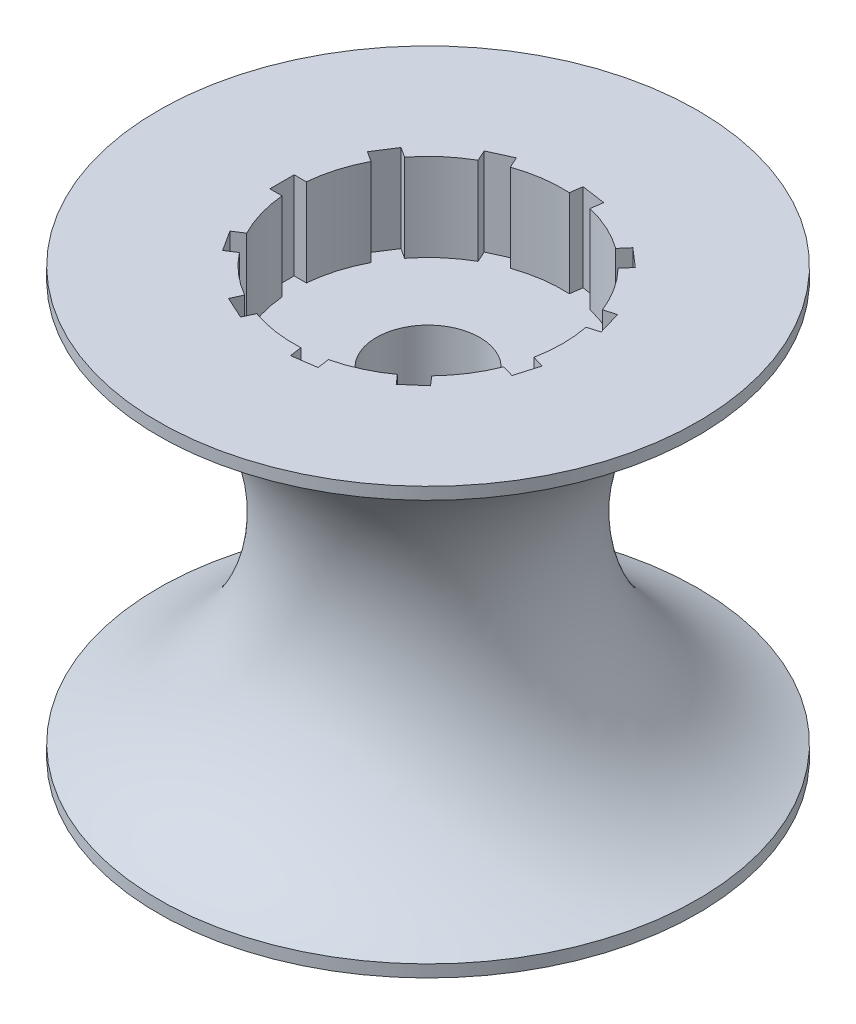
ISO-10303-21;
HEADER;
FILE_DESCRIPTION(('STEP AP214'),'2;1');
FILE_NAME('part.step','',(''),(''),'','','');
FILE_SCHEMA(('AUTOMOTIVE_DESIGN { 1 0 10303 214 1 1 1 1 }'));
ENDSEC;
DATA;
#1=APPLICATION_CONTEXT('core data for automotive mechanical design processes');
#2=APPLICATION_PROTOCOL_DEFINITION('international standard','automotive_design',2000,#1);
#3=PRODUCT_CONTEXT('',#1,'mechanical');
#4=PRODUCT('Part','Part','',(#3));
#5=PRODUCT_RELATED_PRODUCT_CATEGORY('part','',(#4));
#6=PRODUCT_DEFINITION_FORMATION('','',#4);
#7=PRODUCT_DEFINITION_CONTEXT('part definition',#1,'design');
#8=PRODUCT_DEFINITION('design','',#6,#7);
#9=PRODUCT_DEFINITION_SHAPE('','',#8);
#10=(LENGTH_UNIT() NAMED_UNIT(*) SI_UNIT(.MILLI.,.METRE.));
#11=(NAMED_UNIT(*) PLANE_ANGLE_UNIT() SI_UNIT($,.RADIAN.));
#12=(NAMED_UNIT(*) SI_UNIT($,.STERADIAN.) SOLID_ANGLE_UNIT());
#13=UNCERTAINTY_MEASURE_WITH_UNIT(LENGTH_MEASURE(1.E-05),#10,'distance_accuracy_value','');
#14=(GEOMETRIC_REPRESENTATION_CONTEXT(3) GLOBAL_UNCERTAINTY_ASSIGNED_CONTEXT((#13)) GLOBAL_UNIT_ASSIGNED_CONTEXT((#10,
#11,#12)) REPRESENTATION_CONTEXT('',''));
#15=CARTESIAN_POINT('',(0.,0.,0.));
#16=DIRECTION('',(0.,0.,1.));
#17=DIRECTION('',(1.,0.,0.));
#18=AXIS2_PLACEMENT_3D('',#15,#16,#17);
#19=CARTESIAN_POINT('',(0.,7.2,0.));
#20=DIRECTION('',(0.,-1.,0.));
#21=DIRECTION('',(0.,0.,-1.));
#22=AXIS2_PLACEMENT_3D('',#19,#20,#21);
#23=CYLINDRICAL_SURFACE('',#22,11.05);
#24=CARTESIAN_POINT('',(0.,7.2,0.));
#25=DIRECTION('',(0.,-1.,0.));
#26=DIRECTION('',(0.,0.,-1.));
#27=AXIS2_PLACEMENT_3D('',#24,#25,#26);
#28=CIRCLE('',#27,11.05);
#29=CARTESIAN_POINT('',(-9.79834832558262,7.2,5.10831382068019));
#30=VERTEX_POINT('',#29);
#31=CARTESIAN_POINT('',(-11.0046581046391,7.2,1.));
#32=VERTEX_POINT('',#31);
#33=EDGE_CURVE('E887',#30,#32,#28,.T.);
#34=ORIENTED_EDGE('',*,*,#33,.F.);
#35=DIRECTION('',(0.,-1.,0.));
#36=VECTOR('',#35,1.);
#37=CARTESIAN_POINT('',(-9.79834832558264,10.1391372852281,5.10831382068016));
#38=LINE('',#37,#36);
#39=CARTESIAN_POINT('',(-9.79834832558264,0.,5.10831382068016));
#40=VERTEX_POINT('',#39);
#41=EDGE_CURVE('E50',#30,#40,#38,.T.);
#42=ORIENTED_EDGE('',*,*,#41,.T.);
#43=CARTESIAN_POINT('',(0.,0.,0.));
#44=DIRECTION('',(0.,-1.,0.));
#45=DIRECTION('',(0.,0.,-1.));
#46=AXIS2_PLACEMENT_3D('',#43,#44,#45);
#47=CIRCLE('',#46,11.05);
#48=CARTESIAN_POINT('',(-11.0046581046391,0.,1.));
#49=VERTEX_POINT('',#48);
#50=EDGE_CURVE('E882',#40,#49,#47,.T.);
#51=ORIENTED_EDGE('',*,*,#50,.T.);
#52=DIRECTION('',(0.,-1.,0.));
#53=VECTOR('',#52,1.);
#54=CARTESIAN_POINT('',(-11.0046581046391,9.43606797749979,1.));
#55=LINE('',#54,#53);
#56=EDGE_CURVE('E871',#32,#49,#55,.T.);
#57=ORIENTED_EDGE('',*,*,#56,.F.);
#58=EDGE_LOOP('',(#34,#42,#51,#57));
#59=FACE_BOUND('',#58,.T.);
#60=ADVANCED_FACE('F34',(#59),#23,.F.);
#61=CARTESIAN_POINT('',(-5.48113218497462,0.,9.59477409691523));
#62=VERTEX_POINT('',#61);
#63=CARTESIAN_POINT('',(-8.71706669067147,0.,6.79082088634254));
#64=VERTEX_POINT('',#63);
#65=EDGE_CURVE('E996',#62,#64,#47,.T.);
#66=ORIENTED_EDGE('',*,*,#65,.T.);
#67=DIRECTION('',(0.,-1.,0.));
#68=VECTOR('',#67,1.);
#69=CARTESIAN_POINT('',(-8.71706669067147,10.1391372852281,6.79082088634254));
#70=LINE('',#69,#68);
#71=CARTESIAN_POINT('',(-8.71706669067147,7.2,6.79082088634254));
#72=VERTEX_POINT('',#71);
#73=EDGE_CURVE('E827',#72,#64,#70,.T.);
#74=ORIENTED_EDGE('',*,*,#73,.F.);
#75=CARTESIAN_POINT('',(-5.48113218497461,7.2,9.59477409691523));
#76=VERTEX_POINT('',#75);
#77=EDGE_CURVE('E1021',#76,#72,#28,.T.);
#78=ORIENTED_EDGE('',*,*,#77,.F.);
#79=DIRECTION('',(0.,-1.,0.));
#80=VECTOR('',#79,1.);
#81=CARTESIAN_POINT('',(-5.48113218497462,10.0324897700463,9.59477409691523));
#82=LINE('',#81,#80);
#83=EDGE_CURVE('E58',#76,#62,#82,.T.);
#84=ORIENTED_EDGE('',*,*,#83,.T.);
#85=EDGE_LOOP('',(#66,#74,#78,#84));
#86=FACE_BOUND('',#85,.T.);
#87=ADVANCED_FACE('F926',(#86),#23,.F.);
#88=CARTESIAN_POINT('',(0.576304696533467,0.,11.0349613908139));
#89=VERTEX_POINT('',#88);
#90=CARTESIAN_POINT('',(-3.66186819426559,0.,10.425604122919));
#91=VERTEX_POINT('',#90);
#92=EDGE_CURVE('E991',#89,#91,#47,.T.);
#93=ORIENTED_EDGE('',*,*,#92,.T.);
#94=DIRECTION('',(0.,-1.,0.));
#95=VECTOR('',#94,1.);
#96=CARTESIAN_POINT('',(-3.66186819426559,10.0324897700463,10.425604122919));
#97=LINE('',#96,#95);
#98=CARTESIAN_POINT('',(-3.66186819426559,7.2,10.425604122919));
#99=VERTEX_POINT('',#98);
#100=EDGE_CURVE('E808',#99,#91,#97,.T.);
#101=ORIENTED_EDGE('',*,*,#100,.F.);
#102=CARTESIAN_POINT('',(0.576304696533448,7.2,11.0349613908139));
#103=VERTEX_POINT('',#102);
#104=EDGE_CURVE('E1022',#103,#99,#28,.T.);
#105=ORIENTED_EDGE('',*,*,#104,.F.);
#106=DIRECTION('',(0.,-1.,0.));
#107=VECTOR('',#106,1.);
#108=CARTESIAN_POINT('',(0.576304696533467,9.67526366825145,11.0349613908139));
#109=LINE('',#108,#107);
#110=EDGE_CURVE('E775',#103,#89,#109,.T.);
#111=ORIENTED_EDGE('',*,*,#110,.T.);
#112=EDGE_LOOP('',(#93,#101,#105,#111));
#113=FACE_BOUND('',#112,.T.);
#114=ADVANCED_FACE('F933',(#113),#23,.F.);
#115=CARTESIAN_POINT('',(6.45076890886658,0.,8.97162641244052));
#116=VERTEX_POINT('',#115);
#117=CARTESIAN_POINT('',(2.55594758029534,0.,10.7503317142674));
#118=VERTEX_POINT('',#117);
#119=EDGE_CURVE('E986',#116,#118,#47,.T.);
#120=ORIENTED_EDGE('',*,*,#119,.T.);
#121=DIRECTION('',(0.,-1.,0.));
#122=VECTOR('',#121,1.);
#123=CARTESIAN_POINT('',(2.55594758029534,9.67526366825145,10.7503317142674));
#124=LINE('',#123,#122);
#125=CARTESIAN_POINT('',(2.55594758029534,7.2,10.7503317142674));
#126=VERTEX_POINT('',#125);
#127=EDGE_CURVE('E786',#126,#118,#124,.T.);
#128=ORIENTED_EDGE('',*,*,#127,.F.);
#129=CARTESIAN_POINT('',(6.45076890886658,7.2,8.97162641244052));
#130=VERTEX_POINT('',#129);
#131=EDGE_CURVE('E1026',#130,#126,#28,.T.);
#132=ORIENTED_EDGE('',*,*,#131,.F.);
#133=DIRECTION('',(0.,-1.,0.));
#134=VECTOR('',#133,1.);
#135=CARTESIAN_POINT('',(6.45076890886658,10.1932066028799,8.97162641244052));
#136=LINE('',#135,#134);
#137=EDGE_CURVE('E752',#130,#116,#136,.T.);
#138=ORIENTED_EDGE('',*,*,#137,.T.);
#139=EDGE_LOOP('',(#120,#128,#132,#138));
#140=FACE_BOUND('',#139,.T.);
#141=ADVANCED_FACE('F2198',(#140),#23,.F.);
#142=CARTESIAN_POINT('',(10.2771595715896,0.,4.05986343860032));
#143=VERTEX_POINT('',#142);
#144=CARTESIAN_POINT('',(7.96226805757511,0.,7.66190494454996));
#145=VERTEX_POINT('',#144);
#146=EDGE_CURVE('E981',#143,#145,#47,.T.);
#147=ORIENTED_EDGE('',*,*,#146,.T.);
#148=DIRECTION('',(0.,-1.,0.));
#149=VECTOR('',#148,1.);
#150=CARTESIAN_POINT('',(7.96226805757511,10.1932066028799,7.66190494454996));
#151=LINE('',#150,#149);
#152=CARTESIAN_POINT('',(7.96226805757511,7.2,7.66190494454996));
#153=VERTEX_POINT('',#152);
#154=EDGE_CURVE('E763',#153,#145,#151,.T.);
#155=ORIENTED_EDGE('',*,*,#154,.F.);
#156=CARTESIAN_POINT('',(10.2771595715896,7.2,4.05986343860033));
#157=VERTEX_POINT('',#156);
#158=EDGE_CURVE('E1031',#157,#153,#28,.T.);
#159=ORIENTED_EDGE('',*,*,#158,.F.);
#160=DIRECTION('',(0.,-1.,0.));
#161=VECTOR('',#160,1.);
#162=CARTESIAN_POINT('',(10.2771595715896,9.87629655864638,4.05986343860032));
#163=LINE('',#162,#161);
#164=EDGE_CURVE('E729',#157,#143,#163,.T.);
#165=ORIENTED_EDGE('',*,*,#164,.T.);
#166=EDGE_LOOP('',(#147,#155,#159,#165));
#167=FACE_BOUND('',#166,.T.);
#168=ADVANCED_FACE('F2205',(#167),#23,.F.);
#169=CARTESIAN_POINT('',(10.8406246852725,0.,-2.14087749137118));
#170=VERTEX_POINT('',#169);
#171=CARTESIAN_POINT('',(10.8406246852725,0.,2.14087749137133));
#172=VERTEX_POINT('',#171);
#173=EDGE_CURVE('E976',#170,#172,#47,.T.);
#174=ORIENTED_EDGE('',*,*,#173,.T.);
#175=DIRECTION('',(0.,-1.,0.));
#176=VECTOR('',#175,1.);
#177=CARTESIAN_POINT('',(10.8406246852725,9.87629655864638,2.14087749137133));
#178=LINE('',#177,#176);
#179=CARTESIAN_POINT('',(10.8406246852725,7.2,2.14087749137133));
#180=VERTEX_POINT('',#179);
#181=EDGE_CURVE('E740',#180,#172,#178,.T.);
#182=ORIENTED_EDGE('',*,*,#181,.F.);
#183=CARTESIAN_POINT('',(10.8406246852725,7.2,-2.14087749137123));
#184=VERTEX_POINT('',#183);
#185=EDGE_CURVE('E1036',#184,#180,#28,.T.);
#186=ORIENTED_EDGE('',*,*,#185,.F.);
#187=DIRECTION('',(0.,-1.,0.));
#188=VECTOR('',#187,1.);
#189=CARTESIAN_POINT('',(10.8406246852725,9.87629655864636,-2.14087749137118));
#190=LINE('',#189,#188);
#191=EDGE_CURVE('E706',#184,#170,#190,.T.);
#192=ORIENTED_EDGE('',*,*,#191,.T.);
#193=EDGE_LOOP('',(#174,#182,#186,#192));
#194=FACE_BOUND('',#193,.T.);
#195=ADVANCED_FACE('F2212',(#194),#23,.F.);
#196=CARTESIAN_POINT('',(7.96226805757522,0.,-7.66190494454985));
#197=VERTEX_POINT('',#196);
#198=CARTESIAN_POINT('',(10.2771595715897,0.,-4.05986343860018));
#199=VERTEX_POINT('',#198);
#200=EDGE_CURVE('E971',#197,#199,#47,.T.);
#201=ORIENTED_EDGE('',*,*,#200,.T.);
#202=DIRECTION('',(0.,-1.,0.));
#203=VECTOR('',#202,1.);
#204=CARTESIAN_POINT('',(10.2771595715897,9.87629655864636,-4.05986343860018));
#205=LINE('',#204,#203);
#206=CARTESIAN_POINT('',(10.2771595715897,7.2,-4.05986343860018));
#207=VERTEX_POINT('',#206);
#208=EDGE_CURVE('E717',#207,#199,#205,.T.);
#209=ORIENTED_EDGE('',*,*,#208,.F.);
#210=CARTESIAN_POINT('',(7.96226805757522,7.2,-7.66190494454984));
#211=VERTEX_POINT('',#210);
#212=EDGE_CURVE('E1041',#211,#207,#28,.T.);
#213=ORIENTED_EDGE('',*,*,#212,.F.);
#214=DIRECTION('',(0.,-1.,0.));
#215=VECTOR('',#214,1.);
#216=CARTESIAN_POINT('',(7.96226805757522,10.1932066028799,-7.66190494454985));
#217=LINE('',#216,#215);
#218=EDGE_CURVE('E683',#211,#197,#217,.T.);
#219=ORIENTED_EDGE('',*,*,#218,.T.);
#220=EDGE_LOOP('',(#201,#209,#213,#219));
#221=FACE_BOUND('',#220,.T.);
#222=ADVANCED_FACE('F2219',(#221),#23,.F.);
#223=CARTESIAN_POINT('',(2.55594758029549,0.,-10.7503317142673));
#224=VERTEX_POINT('',#223);
#225=CARTESIAN_POINT('',(6.45076890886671,0.,-8.97162641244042));
#226=VERTEX_POINT('',#225);
#227=EDGE_CURVE('E967',#224,#226,#47,.T.);
#228=ORIENTED_EDGE('',*,*,#227,.T.);
#229=DIRECTION('',(0.,-1.,0.));
#230=VECTOR('',#229,1.);
#231=CARTESIAN_POINT('',(6.45076890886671,10.1932066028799,-8.97162641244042));
#232=LINE('',#231,#230);
#233=CARTESIAN_POINT('',(6.45076890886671,7.2,-8.97162641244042));
#234=VERTEX_POINT('',#233);
#235=EDGE_CURVE('E694',#234,#226,#232,.T.);
#236=ORIENTED_EDGE('',*,*,#235,.F.);
#237=CARTESIAN_POINT('',(2.55594758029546,7.2,-10.7503317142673));
#238=VERTEX_POINT('',#237);
#239=EDGE_CURVE('E1046',#238,#234,#28,.T.);
#240=ORIENTED_EDGE('',*,*,#239,.F.);
#241=DIRECTION('',(0.,-1.,0.));
#242=VECTOR('',#241,1.);
#243=CARTESIAN_POINT('',(2.55594758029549,9.67526366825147,-10.7503317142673));
#244=LINE('',#243,#242);
#245=EDGE_CURVE('E660',#238,#224,#244,.T.);
#246=ORIENTED_EDGE('',*,*,#245,.T.);
#247=EDGE_LOOP('',(#228,#236,#240,#246));
#248=FACE_BOUND('',#247,.T.);
#249=ADVANCED_FACE('F955',(#248),#23,.F.);
#250=CARTESIAN_POINT('',(-3.66186819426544,0.,-10.4256041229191));
#251=VERTEX_POINT('',#250);
#252=CARTESIAN_POINT('',(0.576304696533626,0.,-11.0349613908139));
#253=VERTEX_POINT('',#252);
#254=EDGE_CURVE('E965',#251,#253,#47,.T.);
#255=ORIENTED_EDGE('',*,*,#254,.T.);
#256=DIRECTION('',(0.,-1.,0.));
#257=VECTOR('',#256,1.);
#258=CARTESIAN_POINT('',(0.576304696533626,9.67526366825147,-11.0349613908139));
#259=LINE('',#258,#257);
#260=CARTESIAN_POINT('',(0.576304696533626,7.2,-11.0349613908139));
#261=VERTEX_POINT('',#260);
#262=EDGE_CURVE('E671',#261,#253,#259,.T.);
#263=ORIENTED_EDGE('',*,*,#262,.F.);
#264=CARTESIAN_POINT('',(-3.66186819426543,7.2,-10.4256041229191));
#265=VERTEX_POINT('',#264);
#266=EDGE_CURVE('E1051',#265,#261,#28,.T.);
#267=ORIENTED_EDGE('',*,*,#266,.F.);
#268=DIRECTION('',(0.,-1.,0.));
#269=VECTOR('',#268,1.);
#270=CARTESIAN_POINT('',(-3.66186819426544,10.0324897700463,-10.4256041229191));
#271=LINE('',#270,#269);
#272=EDGE_CURVE('E635',#265,#251,#271,.T.);
#273=ORIENTED_EDGE('',*,*,#272,.T.);
#274=EDGE_LOOP('',(#255,#263,#267,#273));
#275=FACE_BOUND('',#274,.T.);
#276=ADVANCED_FACE('F950',(#275),#23,.F.);
#277=CARTESIAN_POINT('',(-8.71706669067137,0.,-6.79082088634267));
#278=VERTEX_POINT('',#277);
#279=CARTESIAN_POINT('',(-5.48113218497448,0.,-9.5947740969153));
#280=VERTEX_POINT('',#279);
#281=EDGE_CURVE('E891',#278,#280,#47,.T.);
#282=ORIENTED_EDGE('',*,*,#281,.T.);
#283=DIRECTION('',(0.,-1.,0.));
#284=VECTOR('',#283,1.);
#285=CARTESIAN_POINT('',(-5.48113218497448,10.0324897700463,-9.5947740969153));
#286=LINE('',#285,#284);
#287=CARTESIAN_POINT('',(-5.48113218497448,7.2,-9.5947740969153));
#288=VERTEX_POINT('',#287);
#289=EDGE_CURVE('E647',#288,#280,#286,.T.);
#290=ORIENTED_EDGE('',*,*,#289,.F.);
#291=CARTESIAN_POINT('',(-8.71706669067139,7.2,-6.79082088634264));
#292=VERTEX_POINT('',#291);
#293=EDGE_CURVE('E886',#292,#288,#28,.T.);
#294=ORIENTED_EDGE('',*,*,#293,.F.);
#295=DIRECTION('',(0.,-1.,0.));
#296=VECTOR('',#295,1.);
#297=CARTESIAN_POINT('',(-8.71706669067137,10.1391372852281,-6.79082088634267));
#298=LINE('',#297,#296);
#299=EDGE_CURVE('E838',#292,#278,#298,.T.);
#300=ORIENTED_EDGE('',*,*,#299,.T.);
#301=EDGE_LOOP('',(#282,#290,#294,#300));
#302=FACE_BOUND('',#301,.T.);
#303=ADVANCED_FACE('F903',(#302),#23,.F.);
#304=CARTESIAN_POINT('',(0.,87.,0.));
#305=DIRECTION('',(0.,-1.,0.));
#306=DIRECTION('',(0.,0.,-1.));
#307=AXIS2_PLACEMENT_3D('',#304,#305,#306);
#308=CYLINDRICAL_SURFACE('',#307,4.25);
#309=CARTESIAN_POINT('',(0.,7.2,0.));
#310=DIRECTION('',(0.,-1.,0.));
#311=DIRECTION('',(0.,0.,-1.));
#312=AXIS2_PLACEMENT_3D('',#309,#310,#311);
#313=CIRCLE('',#312,4.25);
#314=CARTESIAN_POINT('',(0.,7.2,-4.25));
#315=VERTEX_POINT('',#314);
#316=EDGE_CURVE('E38',#315,#315,#313,.F.);
#317=ORIENTED_EDGE('',*,*,#316,.F.);
#318=EDGE_LOOP('',(#317));
#319=FACE_BOUND('',#318,.T.);
#320=CARTESIAN_POINT('',(0.,27.8,0.));
#321=DIRECTION('',(0.,-1.,0.));
#322=DIRECTION('',(0.,0.,-1.));
#323=AXIS2_PLACEMENT_3D('',#320,#321,#322);
#324=CIRCLE('',#323,4.25);
#325=CARTESIAN_POINT('',(0.,27.8,-4.25));
#326=VERTEX_POINT('',#325);
#327=EDGE_CURVE('E626',#326,#326,#324,.F.);
#328=ORIENTED_EDGE('',*,*,#327,.T.);
#329=EDGE_LOOP('',(#328));
#330=FACE_BOUND('',#329,.T.);
#331=ADVANCED_FACE('F900',(#319,#330),#308,.F.);
#332=CARTESIAN_POINT('',(0.,0.,0.));
#333=DIRECTION('',(0.,1.,0.));
#334=DIRECTION('',(0.,0.,1.));
#335=AXIS2_PLACEMENT_3D('',#332,#333,#334);
#336=PLANE('',#335);
#337=ORIENTED_EDGE('',*,*,#50,.F.);
#338=DIRECTION('',(0.841253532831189,0.,-0.540640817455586));
#339=VECTOR('',#338,1.);
#340=CARTESIAN_POINT('',(-9.79834832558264,0.,5.10831382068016));
#341=LINE('',#340,#339);
#342=CARTESIAN_POINT('',(-10.6396018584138,0.,5.64895463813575));
#343=VERTEX_POINT('',#342);
#344=EDGE_CURVE('E825',#343,#40,#341,.T.);
#345=ORIENTED_EDGE('',*,*,#344,.F.);
#346=DIRECTION('',(-0.540640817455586,0.,-0.841253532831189));
#347=VECTOR('',#346,1.);
#348=CARTESIAN_POINT('',(-10.6396018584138,0.,5.64895463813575));
#349=LINE('',#348,#347);
#350=CARTESIAN_POINT('',(-9.55832022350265,0.,7.33146170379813));
#351=VERTEX_POINT('',#350);
#352=EDGE_CURVE('E822',#351,#343,#349,.T.);
#353=ORIENTED_EDGE('',*,*,#352,.F.);
#354=DIRECTION('',(-0.841253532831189,0.,0.540640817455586));
#355=VECTOR('',#354,1.);
#356=CARTESIAN_POINT('',(-9.55832022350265,0.,7.33146170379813));
#357=LINE('',#356,#355);
#358=EDGE_CURVE('E629',#64,#351,#357,.T.);
#359=ORIENTED_EDGE('',*,*,#358,.F.);
#360=ORIENTED_EDGE('',*,*,#65,.F.);
#361=DIRECTION('',(0.415415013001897,0.,-0.909631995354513));
#362=VECTOR('',#361,1.);
#363=CARTESIAN_POINT('',(-5.48113218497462,0.,9.59477409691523));
#364=LINE('',#363,#362);
#365=CARTESIAN_POINT('',(-5.89654719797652,0.,10.5044060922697));
#366=VERTEX_POINT('',#365);
#367=EDGE_CURVE('E806',#366,#62,#364,.T.);
#368=ORIENTED_EDGE('',*,*,#367,.F.);
#369=DIRECTION('',(-0.909631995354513,0.,-0.415415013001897));
#370=VECTOR('',#369,1.);
#371=CARTESIAN_POINT('',(-5.89654719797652,0.,10.5044060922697));
#372=LINE('',#371,#370);
#373=CARTESIAN_POINT('',(-4.07728320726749,0.,11.3352361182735));
#374=VERTEX_POINT('',#373);
#375=EDGE_CURVE('E802',#374,#366,#372,.T.);
#376=ORIENTED_EDGE('',*,*,#375,.F.);
#377=DIRECTION('',(-0.415415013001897,0.,0.909631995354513));
#378=VECTOR('',#377,1.);
#379=CARTESIAN_POINT('',(-4.07728320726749,0.,11.3352361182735));
#380=LINE('',#379,#378);
#381=EDGE_CURVE('E799',#91,#374,#380,.T.);
#382=ORIENTED_EDGE('',*,*,#381,.F.);
#383=ORIENTED_EDGE('',*,*,#92,.F.);
#384=DIRECTION('',(-0.142314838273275,0.,-0.989821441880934));
#385=VECTOR('',#384,1.);
#386=CARTESIAN_POINT('',(0.576304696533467,0.,11.0349613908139));
#387=LINE('',#386,#385);
#388=CARTESIAN_POINT('',(0.718619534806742,0.,12.0247828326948));
#389=VERTEX_POINT('',#388);
#390=EDGE_CURVE('E784',#389,#89,#387,.T.);
#391=ORIENTED_EDGE('',*,*,#390,.F.);
#392=DIRECTION('',(-0.989821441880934,0.,0.142314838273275));
#393=VECTOR('',#392,1.);
#394=CARTESIAN_POINT('',(0.718619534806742,0.,12.0247828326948));
#395=LINE('',#394,#393);
#396=CARTESIAN_POINT('',(2.69826241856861,0.,11.7401531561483));
#397=VERTEX_POINT('',#396);
#398=EDGE_CURVE('E780',#397,#389,#395,.T.);
#399=ORIENTED_EDGE('',*,*,#398,.F.);
#400=DIRECTION('',(0.142314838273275,0.,0.989821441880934));
#401=VECTOR('',#400,1.);
#402=CARTESIAN_POINT('',(2.69826241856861,0.,11.7401531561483));
#403=LINE('',#402,#401);
#404=EDGE_CURVE('E777',#118,#397,#403,.T.);
#405=ORIENTED_EDGE('',*,*,#404,.F.);
#406=ORIENTED_EDGE('',*,*,#119,.F.);
#407=DIRECTION('',(-0.654860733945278,0.,-0.755749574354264));
#408=VECTOR('',#407,1.);
#409=CARTESIAN_POINT('',(6.45076890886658,0.,8.97162641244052));
#410=LINE('',#409,#408);
#411=CARTESIAN_POINT('',(7.10562964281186,0.,9.72737598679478));
#412=VERTEX_POINT('',#411);
#413=EDGE_CURVE('E761',#412,#116,#410,.T.);
#414=ORIENTED_EDGE('',*,*,#413,.F.);
#415=DIRECTION('',(-0.755749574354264,0.,0.654860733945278));
#416=VECTOR('',#415,1.);
#417=CARTESIAN_POINT('',(7.10562964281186,0.,9.72737598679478));
#418=LINE('',#417,#416);
#419=CARTESIAN_POINT('',(8.61712879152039,0.,8.41765451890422));
#420=VERTEX_POINT('',#419);
#421=EDGE_CURVE('E757',#420,#412,#418,.T.);
#422=ORIENTED_EDGE('',*,*,#421,.F.);
#423=DIRECTION('',(0.654860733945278,0.,0.755749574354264));
#424=VECTOR('',#423,1.);
#425=CARTESIAN_POINT('',(8.61712879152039,0.,8.41765451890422));
#426=LINE('',#425,#424);
#427=EDGE_CURVE('E754',#145,#420,#426,.T.);
#428=ORIENTED_EDGE('',*,*,#427,.F.);
#429=ORIENTED_EDGE('',*,*,#146,.F.);
#430=DIRECTION('',(-0.959492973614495,0.,-0.281732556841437));
#431=VECTOR('',#430,1.);
#432=CARTESIAN_POINT('',(10.2771595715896,0.,4.05986343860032));
#433=LINE('',#432,#431);
#434=CARTESIAN_POINT('',(11.2366525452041,0.,4.34159599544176));
#435=VERTEX_POINT('',#434);
#436=EDGE_CURVE('E738',#435,#143,#433,.T.);
#437=ORIENTED_EDGE('',*,*,#436,.F.);
#438=DIRECTION('',(-0.281732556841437,0.,0.959492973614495));
#439=VECTOR('',#438,1.);
#440=CARTESIAN_POINT('',(11.2366525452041,0.,4.34159599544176));
#441=LINE('',#440,#439);
#442=CARTESIAN_POINT('',(11.800117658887,0.,2.42261004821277));
#443=VERTEX_POINT('',#442);
#444=EDGE_CURVE('E734',#443,#435,#441,.T.);
#445=ORIENTED_EDGE('',*,*,#444,.F.);
#446=DIRECTION('',(0.959492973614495,0.,0.281732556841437));
#447=VECTOR('',#446,1.);
#448=CARTESIAN_POINT('',(11.800117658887,0.,2.42261004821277));
#449=LINE('',#448,#447);
#450=EDGE_CURVE('E731',#172,#443,#449,.T.);
#451=ORIENTED_EDGE('',*,*,#450,.F.);
#452=ORIENTED_EDGE('',*,*,#173,.F.);
#453=DIRECTION('',(-0.959492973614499,0.,0.281732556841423));
#454=VECTOR('',#453,1.);
#455=CARTESIAN_POINT('',(10.8406246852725,0.,-2.14087749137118));
#456=LINE('',#455,#454);
#457=CARTESIAN_POINT('',(11.800117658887,0.,-2.4226100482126));
#458=VERTEX_POINT('',#457);
#459=EDGE_CURVE('E715',#458,#170,#456,.T.);
#460=ORIENTED_EDGE('',*,*,#459,.F.);
#461=DIRECTION('',(0.281732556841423,0.,0.959492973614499));
#462=VECTOR('',#461,1.);
#463=CARTESIAN_POINT('',(11.800117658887,0.,-2.4226100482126));
#464=LINE('',#463,#462);
#465=CARTESIAN_POINT('',(11.2366525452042,0.,-4.3415959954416));
#466=VERTEX_POINT('',#465);
#467=EDGE_CURVE('E711',#466,#458,#464,.T.);
#468=ORIENTED_EDGE('',*,*,#467,.F.);
#469=DIRECTION('',(0.959492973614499,0.,-0.281732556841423));
#470=VECTOR('',#469,1.);
#471=CARTESIAN_POINT('',(11.2366525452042,0.,-4.3415959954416));
#472=LINE('',#471,#470);
#473=EDGE_CURVE('E708',#199,#466,#472,.T.);
#474=ORIENTED_EDGE('',*,*,#473,.F.);
#475=ORIENTED_EDGE('',*,*,#200,.F.);
#476=DIRECTION('',(-0.654860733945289,0.,0.755749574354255));
#477=VECTOR('',#476,1.);
#478=CARTESIAN_POINT('',(7.96226805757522,0.,-7.66190494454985));
#479=LINE('',#478,#477);
#480=CARTESIAN_POINT('',(8.61712879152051,0.,-8.4176545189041));
#481=VERTEX_POINT('',#480);
#482=EDGE_CURVE('E692',#481,#197,#479,.T.);
#483=ORIENTED_EDGE('',*,*,#482,.F.);
#484=DIRECTION('',(0.755749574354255,0.,0.654860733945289));
#485=VECTOR('',#484,1.);
#486=CARTESIAN_POINT('',(8.61712879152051,0.,-8.4176545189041));
#487=LINE('',#486,#485);
#488=CARTESIAN_POINT('',(7.105629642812,0.,-9.72737598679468));
#489=VERTEX_POINT('',#488);
#490=EDGE_CURVE('E688',#489,#481,#487,.T.);
#491=ORIENTED_EDGE('',*,*,#490,.F.);
#492=DIRECTION('',(0.654860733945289,0.,-0.755749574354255));
#493=VECTOR('',#492,1.);
#494=CARTESIAN_POINT('',(7.105629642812,0.,-9.72737598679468));
#495=LINE('',#494,#493);
#496=EDGE_CURVE('E685',#226,#489,#495,.T.);
#497=ORIENTED_EDGE('',*,*,#496,.F.);
#498=ORIENTED_EDGE('',*,*,#227,.F.);
#499=DIRECTION('',(-0.142314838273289,0.,0.989821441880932));
#500=VECTOR('',#499,1.);
#501=CARTESIAN_POINT('',(2.55594758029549,0.,-10.7503317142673));
#502=LINE('',#501,#500);
#503=CARTESIAN_POINT('',(2.69826241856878,0.,-11.7401531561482));
#504=VERTEX_POINT('',#503);
#505=EDGE_CURVE('E669',#504,#224,#502,.T.);
#506=ORIENTED_EDGE('',*,*,#505,.F.);
#507=DIRECTION('',(0.989821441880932,0.,0.142314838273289));
#508=VECTOR('',#507,1.);
#509=CARTESIAN_POINT('',(2.69826241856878,0.,-11.7401531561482));
#510=LINE('',#509,#508);
#511=CARTESIAN_POINT('',(0.718619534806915,0.,-12.0247828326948));
#512=VERTEX_POINT('',#511);
#513=EDGE_CURVE('E665',#512,#504,#510,.T.);
#514=ORIENTED_EDGE('',*,*,#513,.F.);
#515=DIRECTION('',(0.142314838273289,0.,-0.989821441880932));
#516=VECTOR('',#515,1.);
#517=CARTESIAN_POINT('',(0.718619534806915,0.,-12.0247828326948));
#518=LINE('',#517,#516);
#519=EDGE_CURVE('E662',#253,#512,#518,.T.);
#520=ORIENTED_EDGE('',*,*,#519,.F.);
#521=ORIENTED_EDGE('',*,*,#254,.F.);
#522=DIRECTION('',(0.415415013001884,0.,0.909631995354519));
#523=VECTOR('',#522,1.);
#524=CARTESIAN_POINT('',(-3.66186819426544,0.,-10.4256041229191));
#525=LINE('',#524,#523);
#526=CARTESIAN_POINT('',(-4.07728320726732,0.,-11.3352361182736));
#527=VERTEX_POINT('',#526);
#528=EDGE_CURVE('E645',#527,#251,#525,.T.);
#529=ORIENTED_EDGE('',*,*,#528,.F.);
#530=DIRECTION('',(0.909631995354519,0.,-0.415415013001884));
#531=VECTOR('',#530,1.);
#532=CARTESIAN_POINT('',(-4.07728320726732,0.,-11.3352361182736));
#533=LINE('',#532,#531);
#534=CARTESIAN_POINT('',(-5.89654719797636,0.,-10.5044060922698));
#535=VERTEX_POINT('',#534);
#536=EDGE_CURVE('E641',#535,#527,#533,.T.);
#537=ORIENTED_EDGE('',*,*,#536,.F.);
#538=DIRECTION('',(-0.415415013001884,0.,-0.909631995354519));
#539=VECTOR('',#538,1.);
#540=CARTESIAN_POINT('',(-5.89654719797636,0.,-10.5044060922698));
#541=LINE('',#540,#539);
#542=EDGE_CURVE('E638',#280,#535,#541,.T.);
#543=ORIENTED_EDGE('',*,*,#542,.F.);
#544=ORIENTED_EDGE('',*,*,#281,.F.);
#545=DIRECTION('',(0.841253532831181,0.,0.540640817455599));
#546=VECTOR('',#545,1.);
#547=CARTESIAN_POINT('',(-8.71706669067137,0.,-6.79082088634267));
#548=LINE('',#547,#546);
#549=CARTESIAN_POINT('',(-9.55832022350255,0.,-7.33146170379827));
#550=VERTEX_POINT('',#549);
#551=EDGE_CURVE('E846',#550,#278,#548,.T.);
#552=ORIENTED_EDGE('',*,*,#551,.F.);
#553=DIRECTION('',(0.540640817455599,0.,-0.841253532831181));
#554=VECTOR('',#553,1.);
#555=CARTESIAN_POINT('',(-9.55832022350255,0.,-7.33146170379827));
#556=LINE('',#555,#554);
#557=CARTESIAN_POINT('',(-10.6396018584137,0.,-5.64895463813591));
#558=VERTEX_POINT('',#557);
#559=EDGE_CURVE('E843',#558,#550,#556,.T.);
#560=ORIENTED_EDGE('',*,*,#559,.F.);
#561=DIRECTION('',(-0.841253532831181,0.,-0.540640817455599));
#562=VECTOR('',#561,1.);
#563=CARTESIAN_POINT('',(-10.6396018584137,0.,-5.64895463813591));
#564=LINE('',#563,#562);
#565=CARTESIAN_POINT('',(-9.79834832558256,0.,-5.10831382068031));
#566=VERTEX_POINT('',#565);
#567=EDGE_CURVE('E656',#566,#558,#564,.T.);
#568=ORIENTED_EDGE('',*,*,#567,.F.);
#569=CARTESIAN_POINT('',(-11.0046581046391,0.,-1.));
#570=VERTEX_POINT('',#569);
#571=EDGE_CURVE('E888',#570,#566,#47,.T.);
#572=ORIENTED_EDGE('',*,*,#571,.F.);
#573=DIRECTION('',(1.,0.,0.));
#574=VECTOR('',#573,1.);
#575=CARTESIAN_POINT('',(-11.0046581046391,0.,-1.));
#576=LINE('',#575,#574);
#577=CARTESIAN_POINT('',(-12.0046581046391,0.,-1.));
#578=VERTEX_POINT('',#577);
#579=EDGE_CURVE('E869',#578,#570,#576,.T.);
#580=ORIENTED_EDGE('',*,*,#579,.F.);
#581=DIRECTION('',(0.,0.,-1.));
#582=VECTOR('',#581,1.);
#583=CARTESIAN_POINT('',(-12.0046581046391,0.,-1.));
#584=LINE('',#583,#582);
#585=CARTESIAN_POINT('',(-12.0046581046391,0.,1.));
#586=VERTEX_POINT('',#585);
#587=EDGE_CURVE('E866',#586,#578,#584,.T.);
#588=ORIENTED_EDGE('',*,*,#587,.F.);
#589=DIRECTION('',(-1.,0.,0.));
#590=VECTOR('',#589,1.);
#591=CARTESIAN_POINT('',(-12.0046581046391,0.,1.));
#592=LINE('',#591,#590);
#593=EDGE_CURVE('E857',#49,#586,#592,.T.);
#594=ORIENTED_EDGE('',*,*,#593,.F.);
#595=EDGE_LOOP('',(#337,#345,#353,#359,#360,#368,#376,#382,#383,#391,#399,#405,#406,#414,#422,
#428,#429,#437,#445,#451,#452,#460,#468,#474,#475,#483,#491,#497,#498,#506,#514,#520,#521,#529,
#537,#543,#544,#552,#560,#568,#572,#580,#588,#594));
#596=FACE_BOUND('',#595,.T.);
#597=CARTESIAN_POINT('',(0.,0.,0.));
#598=DIRECTION('',(0.,-1.,0.));
#599=DIRECTION('',(0.,0.,-1.));
#600=AXIS2_PLACEMENT_3D('',#597,#598,#599);
#601=CIRCLE('',#600,22.1690481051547);
#602=CARTESIAN_POINT('',(0.,0.,-22.1690481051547));
#603=VERTEX_POINT('',#602);
#604=EDGE_CURVE('E11',#603,#603,#601,.T.);
#605=ORIENTED_EDGE('',*,*,#604,.T.);
#606=EDGE_LOOP('',(#605));
#607=FACE_BOUND('',#606,.T.);
#608=ADVANCED_FACE('F36',(#596,#607),#336,.F.);
#609=CARTESIAN_POINT('',(0.,0.,0.));
#610=DIRECTION('',(0.,-1.,0.));
#611=DIRECTION('',(0.,0.,-1.));
#612=AXIS2_PLACEMENT_3D('',#609,#610,#611);
#613=CYLINDRICAL_SURFACE('',#612,22.1690481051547);
#614=ORIENTED_EDGE('',*,*,#604,.F.);
#615=EDGE_LOOP('',(#614));
#616=FACE_BOUND('',#615,.T.);
#617=CARTESIAN_POINT('',(0.,0.99999999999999,0.));
#618=DIRECTION('',(0.,-1.,0.));
#619=DIRECTION('',(0.,0.,-1.));
#620=AXIS2_PLACEMENT_3D('',#617,#618,#619);
#621=CIRCLE('',#620,22.1690481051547);
#622=CARTESIAN_POINT('',(0.,0.99999999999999,-22.1690481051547));
#623=VERTEX_POINT('',#622);
#624=EDGE_CURVE('E43',#623,#623,#621,.T.);
#625=ORIENTED_EDGE('',*,*,#624,.T.);
#626=EDGE_LOOP('',(#625));
#627=FACE_BOUND('',#626,.T.);
#628=ADVANCED_FACE('F2023',(#616,#627),#613,.T.);
#629=CARTESIAN_POINT('',(0.,17.5,0.));
#630=DIRECTION('',(0.,-1.,0.));
#631=DIRECTION('',(0.,0.,-1.));
#632=AXIS2_PLACEMENT_3D('',#629,#630,#631);
#633=TOROIDAL_SURFACE('',#632,28.,17.5);
#634=ORIENTED_EDGE('',*,*,#624,.F.);
#635=EDGE_LOOP('',(#634));
#636=FACE_BOUND('',#635,.T.);
#637=CARTESIAN_POINT('',(0.,34.,0.));
#638=DIRECTION('',(0.,-1.,0.));
#639=DIRECTION('',(0.,0.,-1.));
#640=AXIS2_PLACEMENT_3D('',#637,#638,#639);
#641=CIRCLE('',#640,22.1690481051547);
#642=CARTESIAN_POINT('',(0.,34.,-22.1690481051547));
#643=VERTEX_POINT('',#642);
#644=EDGE_CURVE('E622',#643,#643,#641,.T.);
#645=ORIENTED_EDGE('',*,*,#644,.T.);
#646=EDGE_LOOP('',(#645));
#647=FACE_BOUND('',#646,.T.);
#648=ADVANCED_FACE('F947',(#636,#647),#633,.F.);
#649=CARTESIAN_POINT('',(0.,7.2,0.));
#650=DIRECTION('',(0.,-1.,0.));
#651=DIRECTION('',(0.,0.,-1.));
#652=AXIS2_PLACEMENT_3D('',#649,#650,#651);
#653=PLANE('',#652);
#654=ORIENTED_EDGE('',*,*,#77,.T.);
#655=DIRECTION('',(0.841253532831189,0.,-0.540640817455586));
#656=VECTOR('',#655,1.);
#657=CARTESIAN_POINT('',(-9.55832022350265,7.2,7.33146170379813));
#658=LINE('',#657,#656);
#659=CARTESIAN_POINT('',(-9.55832022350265,7.2,7.33146170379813));
#660=VERTEX_POINT('',#659);
#661=EDGE_CURVE('E803',#660,#72,#658,.T.);
#662=ORIENTED_EDGE('',*,*,#661,.F.);
#663=DIRECTION('',(0.540640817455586,0.,0.841253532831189));
#664=VECTOR('',#663,1.);
#665=CARTESIAN_POINT('',(-10.6396018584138,7.2,5.64895463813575));
#666=LINE('',#665,#664);
#667=CARTESIAN_POINT('',(-10.6396018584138,7.2,5.64895463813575));
#668=VERTEX_POINT('',#667);
#669=EDGE_CURVE('E816',#668,#660,#666,.T.);
#670=ORIENTED_EDGE('',*,*,#669,.F.);
#671=DIRECTION('',(-0.841253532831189,0.,0.540640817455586));
#672=VECTOR('',#671,1.);
#673=CARTESIAN_POINT('',(-9.79834832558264,7.2,5.10831382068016));
#674=LINE('',#673,#672);
#675=EDGE_CURVE('E818',#30,#668,#674,.T.);
#676=ORIENTED_EDGE('',*,*,#675,.F.);
#677=ORIENTED_EDGE('',*,*,#33,.T.);
#678=DIRECTION('',(1.,0.,0.));
#679=VECTOR('',#678,1.);
#680=CARTESIAN_POINT('',(-12.0046581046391,7.2,1.));
#681=LINE('',#680,#679);
#682=CARTESIAN_POINT('',(-12.0046581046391,7.2,1.));
#683=VERTEX_POINT('',#682);
#684=EDGE_CURVE('E863',#683,#32,#681,.T.);
#685=ORIENTED_EDGE('',*,*,#684,.F.);
#686=DIRECTION('',(0.,0.,1.));
#687=VECTOR('',#686,1.);
#688=CARTESIAN_POINT('',(-12.0046581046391,7.2,-1.));
#689=LINE('',#688,#687);
#690=CARTESIAN_POINT('',(-12.0046581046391,7.2,-1.));
#691=VERTEX_POINT('',#690);
#692=EDGE_CURVE('E858',#691,#683,#689,.T.);
#693=ORIENTED_EDGE('',*,*,#692,.F.);
#694=DIRECTION('',(-1.,0.,0.));
#695=VECTOR('',#694,1.);
#696=CARTESIAN_POINT('',(-11.0046581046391,7.2,-1.));
#697=LINE('',#696,#695);
#698=CARTESIAN_POINT('',(-11.0046581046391,7.2,-1.00000000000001));
#699=VERTEX_POINT('',#698);
#700=EDGE_CURVE('E860',#699,#691,#697,.T.);
#701=ORIENTED_EDGE('',*,*,#700,.F.);
#702=CARTESIAN_POINT('',(-9.79834832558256,7.2,-5.10831382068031));
#703=VERTEX_POINT('',#702);
#704=EDGE_CURVE('E883',#699,#703,#28,.T.);
#705=ORIENTED_EDGE('',*,*,#704,.T.);
#706=DIRECTION('',(0.84125353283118,0.,0.540640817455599));
#707=VECTOR('',#706,1.);
#708=CARTESIAN_POINT('',(-10.6396018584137,7.2,-5.64895463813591));
#709=LINE('',#708,#707);
#710=CARTESIAN_POINT('',(-10.6396018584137,7.2,-5.64895463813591));
#711=VERTEX_POINT('',#710);
#712=EDGE_CURVE('E840',#711,#703,#709,.T.);
#713=ORIENTED_EDGE('',*,*,#712,.F.);
#714=DIRECTION('',(-0.540640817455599,0.,0.84125353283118));
#715=VECTOR('',#714,1.);
#716=CARTESIAN_POINT('',(-9.55832022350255,7.2,-7.33146170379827));
#717=LINE('',#716,#715);
#718=CARTESIAN_POINT('',(-9.55832022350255,7.2,-7.33146170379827));
#719=VERTEX_POINT('',#718);
#720=EDGE_CURVE('E835',#719,#711,#717,.T.);
#721=ORIENTED_EDGE('',*,*,#720,.F.);
#722=DIRECTION('',(-0.84125353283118,0.,-0.540640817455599));
#723=VECTOR('',#722,1.);
#724=CARTESIAN_POINT('',(-8.71706669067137,7.2,-6.79082088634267));
#725=LINE('',#724,#723);
#726=EDGE_CURVE('E837',#292,#719,#725,.T.);
#727=ORIENTED_EDGE('',*,*,#726,.F.);
#728=ORIENTED_EDGE('',*,*,#293,.T.);
#729=DIRECTION('',(0.415415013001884,0.,0.909631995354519));
#730=VECTOR('',#729,1.);
#731=CARTESIAN_POINT('',(-5.89654719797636,7.2,-10.5044060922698));
#732=LINE('',#731,#730);
#733=CARTESIAN_POINT('',(-5.89654719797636,7.2,-10.5044060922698));
#734=VERTEX_POINT('',#733);
#735=EDGE_CURVE('E637',#734,#288,#732,.T.);
#736=ORIENTED_EDGE('',*,*,#735,.F.);
#737=DIRECTION('',(-0.909631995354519,0.,0.415415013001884));
#738=VECTOR('',#737,1.);
#739=CARTESIAN_POINT('',(-4.07728320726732,7.2,-11.3352361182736));
#740=LINE('',#739,#738);
#741=CARTESIAN_POINT('',(-4.07728320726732,7.2,-11.3352361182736));
#742=VERTEX_POINT('',#741);
#743=EDGE_CURVE('E632',#742,#734,#740,.T.);
#744=ORIENTED_EDGE('',*,*,#743,.F.);
#745=DIRECTION('',(-0.415415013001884,0.,-0.909631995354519));
#746=VECTOR('',#745,1.);
#747=CARTESIAN_POINT('',(-3.66186819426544,7.2,-10.4256041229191));
#748=LINE('',#747,#746);
#749=EDGE_CURVE('E634',#265,#742,#748,.T.);
#750=ORIENTED_EDGE('',*,*,#749,.F.);
#751=ORIENTED_EDGE('',*,*,#266,.T.);
#752=DIRECTION('',(-0.142314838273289,0.,0.989821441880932));
#753=VECTOR('',#752,1.);
#754=CARTESIAN_POINT('',(0.718619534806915,7.2,-12.0247828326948));
#755=LINE('',#754,#753);
#756=CARTESIAN_POINT('',(0.718619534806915,7.2,-12.0247828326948));
#757=VERTEX_POINT('',#756);
#758=EDGE_CURVE('E642',#757,#261,#755,.T.);
#759=ORIENTED_EDGE('',*,*,#758,.F.);
#760=DIRECTION('',(-0.989821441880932,0.,-0.142314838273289));
#761=VECTOR('',#760,1.);
#762=CARTESIAN_POINT('',(2.69826241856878,7.2,-11.7401531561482));
#763=LINE('',#762,#761);
#764=CARTESIAN_POINT('',(2.69826241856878,7.2,-11.7401531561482));
#765=VERTEX_POINT('',#764);
#766=EDGE_CURVE('E657',#765,#757,#763,.T.);
#767=ORIENTED_EDGE('',*,*,#766,.F.);
#768=DIRECTION('',(0.142314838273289,0.,-0.989821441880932));
#769=VECTOR('',#768,1.);
#770=CARTESIAN_POINT('',(2.55594758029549,7.2,-10.7503317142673));
#771=LINE('',#770,#769);
#772=EDGE_CURVE('E659',#238,#765,#771,.T.);
#773=ORIENTED_EDGE('',*,*,#772,.F.);
#774=ORIENTED_EDGE('',*,*,#239,.T.);
#775=DIRECTION('',(-0.654860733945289,0.,0.755749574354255));
#776=VECTOR('',#775,1.);
#777=CARTESIAN_POINT('',(7.105629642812,7.2,-9.72737598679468));
#778=LINE('',#777,#776);
#779=CARTESIAN_POINT('',(7.105629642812,7.2,-9.72737598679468));
#780=VERTEX_POINT('',#779);
#781=EDGE_CURVE('E666',#780,#234,#778,.T.);
#782=ORIENTED_EDGE('',*,*,#781,.F.);
#783=DIRECTION('',(-0.755749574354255,0.,-0.654860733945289));
#784=VECTOR('',#783,1.);
#785=CARTESIAN_POINT('',(8.61712879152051,7.2,-8.4176545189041));
#786=LINE('',#785,#784);
#787=CARTESIAN_POINT('',(8.61712879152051,7.2,-8.4176545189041));
#788=VERTEX_POINT('',#787);
#789=EDGE_CURVE('E680',#788,#780,#786,.T.);
#790=ORIENTED_EDGE('',*,*,#789,.F.);
#791=DIRECTION('',(0.654860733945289,0.,-0.755749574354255));
#792=VECTOR('',#791,1.);
#793=CARTESIAN_POINT('',(7.96226805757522,7.2,-7.66190494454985));
#794=LINE('',#793,#792);
#795=EDGE_CURVE('E682',#211,#788,#794,.T.);
#796=ORIENTED_EDGE('',*,*,#795,.F.);
#797=ORIENTED_EDGE('',*,*,#212,.T.);
#798=DIRECTION('',(-0.959492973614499,0.,0.281732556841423));
#799=VECTOR('',#798,1.);
#800=CARTESIAN_POINT('',(11.2366525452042,7.2,-4.3415959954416));
#801=LINE('',#800,#799);
#802=CARTESIAN_POINT('',(11.2366525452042,7.2,-4.3415959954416));
#803=VERTEX_POINT('',#802);
#804=EDGE_CURVE('E689',#803,#207,#801,.T.);
#805=ORIENTED_EDGE('',*,*,#804,.F.);
#806=DIRECTION('',(-0.281732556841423,0.,-0.959492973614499));
#807=VECTOR('',#806,1.);
#808=CARTESIAN_POINT('',(11.800117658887,7.2,-2.4226100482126));
#809=LINE('',#808,#807);
#810=CARTESIAN_POINT('',(11.800117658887,7.2,-2.4226100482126));
#811=VERTEX_POINT('',#810);
#812=EDGE_CURVE('E703',#811,#803,#809,.T.);
#813=ORIENTED_EDGE('',*,*,#812,.F.);
#814=DIRECTION('',(0.959492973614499,0.,-0.281732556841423));
#815=VECTOR('',#814,1.);
#816=CARTESIAN_POINT('',(10.8406246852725,7.2,-2.14087749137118));
#817=LINE('',#816,#815);
#818=EDGE_CURVE('E705',#184,#811,#817,.T.);
#819=ORIENTED_EDGE('',*,*,#818,.F.);
#820=ORIENTED_EDGE('',*,*,#185,.T.);
#821=DIRECTION('',(-0.959492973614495,0.,-0.281732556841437));
#822=VECTOR('',#821,1.);
#823=CARTESIAN_POINT('',(11.800117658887,7.2,2.42261004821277));
#824=LINE('',#823,#822);
#825=CARTESIAN_POINT('',(11.800117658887,7.2,2.42261004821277));
#826=VERTEX_POINT('',#825);
#827=EDGE_CURVE('E712',#826,#180,#824,.T.);
#828=ORIENTED_EDGE('',*,*,#827,.F.);
#829=DIRECTION('',(0.281732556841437,0.,-0.959492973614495));
#830=VECTOR('',#829,1.);
#831=CARTESIAN_POINT('',(11.2366525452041,7.2,4.34159599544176));
#832=LINE('',#831,#830);
#833=CARTESIAN_POINT('',(11.2366525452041,7.2,4.34159599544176));
#834=VERTEX_POINT('',#833);
#835=EDGE_CURVE('E726',#834,#826,#832,.T.);
#836=ORIENTED_EDGE('',*,*,#835,.F.);
#837=DIRECTION('',(0.959492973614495,0.,0.281732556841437));
#838=VECTOR('',#837,1.);
#839=CARTESIAN_POINT('',(10.2771595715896,7.2,4.05986343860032));
#840=LINE('',#839,#838);
#841=EDGE_CURVE('E728',#157,#834,#840,.T.);
#842=ORIENTED_EDGE('',*,*,#841,.F.);
#843=ORIENTED_EDGE('',*,*,#158,.T.);
#844=DIRECTION('',(-0.654860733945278,0.,-0.755749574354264));
#845=VECTOR('',#844,1.);
#846=CARTESIAN_POINT('',(8.61712879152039,7.2,8.41765451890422));
#847=LINE('',#846,#845);
#848=CARTESIAN_POINT('',(8.61712879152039,7.2,8.41765451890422));
#849=VERTEX_POINT('',#848);
#850=EDGE_CURVE('E735',#849,#153,#847,.T.);
#851=ORIENTED_EDGE('',*,*,#850,.F.);
#852=DIRECTION('',(0.755749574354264,0.,-0.654860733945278));
#853=VECTOR('',#852,1.);
#854=CARTESIAN_POINT('',(7.10562964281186,7.2,9.72737598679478));
#855=LINE('',#854,#853);
#856=CARTESIAN_POINT('',(7.10562964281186,7.2,9.72737598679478));
#857=VERTEX_POINT('',#856);
#858=EDGE_CURVE('E749',#857,#849,#855,.T.);
#859=ORIENTED_EDGE('',*,*,#858,.F.);
#860=DIRECTION('',(0.654860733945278,0.,0.755749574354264));
#861=VECTOR('',#860,1.);
#862=CARTESIAN_POINT('',(6.45076890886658,7.2,8.97162641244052));
#863=LINE('',#862,#861);
#864=EDGE_CURVE('E751',#130,#857,#863,.T.);
#865=ORIENTED_EDGE('',*,*,#864,.F.);
#866=ORIENTED_EDGE('',*,*,#131,.T.);
#867=DIRECTION('',(-0.142314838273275,0.,-0.989821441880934));
#868=VECTOR('',#867,1.);
#869=CARTESIAN_POINT('',(2.69826241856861,7.2,11.7401531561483));
#870=LINE('',#869,#868);
#871=CARTESIAN_POINT('',(2.69826241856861,7.2,11.7401531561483));
#872=VERTEX_POINT('',#871);
#873=EDGE_CURVE('E758',#872,#126,#870,.T.);
#874=ORIENTED_EDGE('',*,*,#873,.F.);
#875=DIRECTION('',(0.989821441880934,0.,-0.142314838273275));
#876=VECTOR('',#875,1.);
#877=CARTESIAN_POINT('',(0.718619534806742,7.2,12.0247828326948));
#878=LINE('',#877,#876);
#879=CARTESIAN_POINT('',(0.718619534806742,7.2,12.0247828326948));
#880=VERTEX_POINT('',#879);
#881=EDGE_CURVE('E772',#880,#872,#878,.T.);
#882=ORIENTED_EDGE('',*,*,#881,.F.);
#883=DIRECTION('',(0.142314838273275,0.,0.989821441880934));
#884=VECTOR('',#883,1.);
#885=CARTESIAN_POINT('',(0.576304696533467,7.2,11.0349613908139));
#886=LINE('',#885,#884);
#887=EDGE_CURVE('E774',#103,#880,#886,.T.);
#888=ORIENTED_EDGE('',*,*,#887,.F.);
#889=ORIENTED_EDGE('',*,*,#104,.T.);
#890=DIRECTION('',(0.415415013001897,0.,-0.909631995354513));
#891=VECTOR('',#890,1.);
#892=CARTESIAN_POINT('',(-4.07728320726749,7.2,11.3352361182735));
#893=LINE('',#892,#891);
#894=CARTESIAN_POINT('',(-4.07728320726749,7.2,11.3352361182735));
#895=VERTEX_POINT('',#894);
#896=EDGE_CURVE('E781',#895,#99,#893,.T.);
#897=ORIENTED_EDGE('',*,*,#896,.F.);
#898=DIRECTION('',(0.909631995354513,0.,0.415415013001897));
#899=VECTOR('',#898,1.);
#900=CARTESIAN_POINT('',(-5.89654719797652,7.2,10.5044060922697));
#901=LINE('',#900,#899);
#902=CARTESIAN_POINT('',(-5.89654719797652,7.2,10.5044060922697));
#903=VERTEX_POINT('',#902);
#904=EDGE_CURVE('E795',#903,#895,#901,.T.);
#905=ORIENTED_EDGE('',*,*,#904,.F.);
#906=DIRECTION('',(-0.415415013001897,0.,0.909631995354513));
#907=VECTOR('',#906,1.);
#908=CARTESIAN_POINT('',(-5.48113218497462,7.2,9.59477409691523));
#909=LINE('',#908,#907);
#910=EDGE_CURVE('E797',#76,#903,#909,.T.);
#911=ORIENTED_EDGE('',*,*,#910,.F.);
#912=EDGE_LOOP('',(#654,#662,#670,#676,#677,#685,#693,#701,#705,#713,#721,#727,#728,#736,#744,
#750,#751,#759,#767,#773,#774,#782,#790,#796,#797,#805,#813,#819,#820,#828,#836,#842,#843,#851,
#859,#865,#866,#874,#882,#888,#889,#897,#905,#911));
#913=FACE_BOUND('',#912,.T.);
#914=ORIENTED_EDGE('',*,*,#316,.T.);
#915=EDGE_LOOP('',(#914));
#916=FACE_BOUND('',#915,.T.);
#917=ADVANCED_FACE('F898',(#913,#916),#653,.T.);
#918=ORIENTED_EDGE('',*,*,#571,.T.);
#919=DIRECTION('',(0.,-1.,0.));
#920=VECTOR('',#919,1.);
#921=CARTESIAN_POINT('',(-9.79834832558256,10.1391372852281,-5.10831382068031));
#922=LINE('',#921,#920);
#923=EDGE_CURVE('E848',#703,#566,#922,.T.);
#924=ORIENTED_EDGE('',*,*,#923,.F.);
#925=ORIENTED_EDGE('',*,*,#704,.F.);
#926=DIRECTION('',(0.,-1.,0.));
#927=VECTOR('',#926,1.);
#928=CARTESIAN_POINT('',(-11.0046581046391,9.43606797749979,-1.));
#929=LINE('',#928,#927);
#930=EDGE_CURVE('E861',#699,#570,#929,.T.);
#931=ORIENTED_EDGE('',*,*,#930,.T.);
#932=EDGE_LOOP('',(#918,#924,#925,#931));
#933=FACE_BOUND('',#932,.T.);
#934=ADVANCED_FACE('F929',(#933),#23,.F.);
#935=CARTESIAN_POINT('',(-11.0046581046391,9.43606797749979,-1.));
#936=DIRECTION('',(0.,0.,-1.));
#937=DIRECTION('',(0.,1.,0.));
#938=AXIS2_PLACEMENT_3D('',#935,#936,#937);
#939=PLANE('',#938);
#940=ORIENTED_EDGE('',*,*,#700,.T.);
#941=DIRECTION('',(0.,-1.,0.));
#942=VECTOR('',#941,1.);
#943=CARTESIAN_POINT('',(-12.0046581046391,9.43606797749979,-1.));
#944=LINE('',#943,#942);
#945=EDGE_CURVE('E874',#691,#578,#944,.T.);
#946=ORIENTED_EDGE('',*,*,#945,.T.);
#947=ORIENTED_EDGE('',*,*,#579,.T.);
#948=ORIENTED_EDGE('',*,*,#930,.F.);
#949=EDGE_LOOP('',(#940,#946,#947,#948));
#950=FACE_BOUND('',#949,.T.);
#951=ADVANCED_FACE('F938',(#950),#939,.F.);
#952=CARTESIAN_POINT('',(-12.0046581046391,9.43606797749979,-1.));
#953=DIRECTION('',(-1.,0.,0.));
#954=DIRECTION('',(0.,0.,1.));
#955=AXIS2_PLACEMENT_3D('',#952,#953,#954);
#956=PLANE('',#955);
#957=ORIENTED_EDGE('',*,*,#692,.T.);
#958=DIRECTION('',(0.,-1.,0.));
#959=VECTOR('',#958,1.);
#960=CARTESIAN_POINT('',(-12.0046581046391,9.43606797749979,1.));
#961=LINE('',#960,#959);
#962=EDGE_CURVE('E876',#683,#586,#961,.T.);
#963=ORIENTED_EDGE('',*,*,#962,.T.);
#964=ORIENTED_EDGE('',*,*,#587,.T.);
#965=ORIENTED_EDGE('',*,*,#945,.F.);
#966=EDGE_LOOP('',(#957,#963,#964,#965));
#967=FACE_BOUND('',#966,.T.);
#968=ADVANCED_FACE('F944',(#967),#956,.F.);
#969=CARTESIAN_POINT('',(-12.0046581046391,9.43606797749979,1.));
#970=DIRECTION('',(0.,0.,1.));
#971=DIRECTION('',(0.,-1.,0.));
#972=AXIS2_PLACEMENT_3D('',#969,#970,#971);
#973=PLANE('',#972);
#974=ORIENTED_EDGE('',*,*,#684,.T.);
#975=ORIENTED_EDGE('',*,*,#56,.T.);
#976=ORIENTED_EDGE('',*,*,#593,.T.);
#977=ORIENTED_EDGE('',*,*,#962,.F.);
#978=EDGE_LOOP('',(#974,#975,#976,#977));
#979=FACE_BOUND('',#978,.T.);
#980=ADVANCED_FACE('F1008',(#979),#973,.F.);
#981=CARTESIAN_POINT('',(-8.71706669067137,10.1391372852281,-6.79082088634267));
#982=DIRECTION('',(0.540640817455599,0.,-0.84125353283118));
#983=DIRECTION('',(-0.84125353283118,0.,-0.540640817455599));
#984=AXIS2_PLACEMENT_3D('',#981,#982,#983);
#985=PLANE('',#984);
#986=ORIENTED_EDGE('',*,*,#726,.T.);
#987=DIRECTION('',(0.,-1.,0.));
#988=VECTOR('',#987,1.);
#989=CARTESIAN_POINT('',(-9.55832022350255,10.1391372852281,-7.33146170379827));
#990=LINE('',#989,#988);
#991=EDGE_CURVE('E851',#719,#550,#990,.T.);
#992=ORIENTED_EDGE('',*,*,#991,.T.);
#993=ORIENTED_EDGE('',*,*,#551,.T.);
#994=ORIENTED_EDGE('',*,*,#299,.F.);
#995=EDGE_LOOP('',(#986,#992,#993,#994));
#996=FACE_BOUND('',#995,.T.);
#997=ADVANCED_FACE('F1066',(#996),#985,.F.);
#998=CARTESIAN_POINT('',(-9.55832022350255,10.1391372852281,-7.33146170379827));
#999=DIRECTION('',(-0.84125353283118,0.,-0.540640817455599));
#1000=DIRECTION('',(-0.540640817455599,0.,0.84125353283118));
#1001=AXIS2_PLACEMENT_3D('',#998,#999,#1000);
#1002=PLANE('',#1001);
#1003=ORIENTED_EDGE('',*,*,#720,.T.);
#1004=DIRECTION('',(0.,-1.,0.));
#1005=VECTOR('',#1004,1.);
#1006=CARTESIAN_POINT('',(-10.6396018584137,10.1391372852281,-5.64895463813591));
#1007=LINE('',#1006,#1005);
#1008=EDGE_CURVE('E853',#711,#558,#1007,.T.);
#1009=ORIENTED_EDGE('',*,*,#1008,.T.);
#1010=ORIENTED_EDGE('',*,*,#559,.T.);
#1011=ORIENTED_EDGE('',*,*,#991,.F.);
#1012=EDGE_LOOP('',(#1003,#1009,#1010,#1011));
#1013=FACE_BOUND('',#1012,.T.);
#1014=ADVANCED_FACE('F1070',(#1013),#1002,.F.);
#1015=CARTESIAN_POINT('',(-10.6396018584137,10.1391372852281,-5.64895463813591));
#1016=DIRECTION('',(-0.540640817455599,0.,0.84125353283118));
#1017=DIRECTION('',(0.84125353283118,0.,0.540640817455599));
#1018=AXIS2_PLACEMENT_3D('',#1015,#1016,#1017);
#1019=PLANE('',#1018);
#1020=ORIENTED_EDGE('',*,*,#712,.T.);
#1021=ORIENTED_EDGE('',*,*,#923,.T.);
#1022=ORIENTED_EDGE('',*,*,#567,.T.);
#1023=ORIENTED_EDGE('',*,*,#1008,.F.);
#1024=EDGE_LOOP('',(#1020,#1021,#1022,#1023));
#1025=FACE_BOUND('',#1024,.T.);
#1026=ADVANCED_FACE('F1073',(#1025),#1019,.F.);
#1027=CARTESIAN_POINT('',(-3.66186819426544,10.0324897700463,-10.4256041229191));
#1028=DIRECTION('',(0.909631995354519,0.,-0.415415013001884));
#1029=DIRECTION('',(-0.415415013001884,0.,-0.909631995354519));
#1030=AXIS2_PLACEMENT_3D('',#1027,#1028,#1029);
#1031=PLANE('',#1030);
#1032=ORIENTED_EDGE('',*,*,#749,.T.);
#1033=DIRECTION('',(0.,-1.,0.));
#1034=VECTOR('',#1033,1.);
#1035=CARTESIAN_POINT('',(-4.07728320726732,10.0324897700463,-11.3352361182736));
#1036=LINE('',#1035,#1034);
#1037=EDGE_CURVE('E650',#742,#527,#1036,.T.);
#1038=ORIENTED_EDGE('',*,*,#1037,.T.);
#1039=ORIENTED_EDGE('',*,*,#528,.T.);
#1040=ORIENTED_EDGE('',*,*,#272,.F.);
#1041=EDGE_LOOP('',(#1032,#1038,#1039,#1040));
#1042=FACE_BOUND('',#1041,.T.);
#1043=ADVANCED_FACE('F1077',(#1042),#1031,.F.);
#1044=CARTESIAN_POINT('',(-4.07728320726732,10.0324897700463,-11.3352361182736));
#1045=DIRECTION('',(-0.415415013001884,0.,-0.909631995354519));
#1046=DIRECTION('',(-0.909631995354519,0.,0.415415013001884));
#1047=AXIS2_PLACEMENT_3D('',#1044,#1045,#1046);
#1048=PLANE('',#1047);
#1049=ORIENTED_EDGE('',*,*,#743,.T.);
#1050=DIRECTION('',(0.,-1.,0.));
#1051=VECTOR('',#1050,1.);
#1052=CARTESIAN_POINT('',(-5.89654719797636,10.0324897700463,-10.5044060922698));
#1053=LINE('',#1052,#1051);
#1054=EDGE_CURVE('E652',#734,#535,#1053,.T.);
#1055=ORIENTED_EDGE('',*,*,#1054,.T.);
#1056=ORIENTED_EDGE('',*,*,#536,.T.);
#1057=ORIENTED_EDGE('',*,*,#1037,.F.);
#1058=EDGE_LOOP('',(#1049,#1055,#1056,#1057));
#1059=FACE_BOUND('',#1058,.T.);
#1060=ADVANCED_FACE('F1083',(#1059),#1048,.F.);
#1061=CARTESIAN_POINT('',(-5.89654719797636,10.0324897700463,-10.5044060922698));
#1062=DIRECTION('',(-0.909631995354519,0.,0.415415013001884));
#1063=DIRECTION('',(0.415415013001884,0.,0.909631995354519));
#1064=AXIS2_PLACEMENT_3D('',#1061,#1062,#1063);
#1065=PLANE('',#1064);
#1066=ORIENTED_EDGE('',*,*,#735,.T.);
#1067=ORIENTED_EDGE('',*,*,#289,.T.);
#1068=ORIENTED_EDGE('',*,*,#542,.T.);
#1069=ORIENTED_EDGE('',*,*,#1054,.F.);
#1070=EDGE_LOOP('',(#1066,#1067,#1068,#1069));
#1071=FACE_BOUND('',#1070,.T.);
#1072=ADVANCED_FACE('F1191',(#1071),#1065,.F.);
#1073=CARTESIAN_POINT('',(2.55594758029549,9.67526366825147,-10.7503317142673));
#1074=DIRECTION('',(0.989821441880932,0.,0.142314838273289));
#1075=DIRECTION('',(0.142314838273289,0.,-0.989821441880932));
#1076=AXIS2_PLACEMENT_3D('',#1073,#1074,#1075);
#1077=PLANE('',#1076);
#1078=ORIENTED_EDGE('',*,*,#772,.T.);
#1079=DIRECTION('',(0.,-1.,0.));
#1080=VECTOR('',#1079,1.);
#1081=CARTESIAN_POINT('',(2.69826241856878,9.67526366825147,-11.7401531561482));
#1082=LINE('',#1081,#1080);
#1083=EDGE_CURVE('E674',#765,#504,#1082,.T.);
#1084=ORIENTED_EDGE('',*,*,#1083,.T.);
#1085=ORIENTED_EDGE('',*,*,#505,.T.);
#1086=ORIENTED_EDGE('',*,*,#245,.F.);
#1087=EDGE_LOOP('',(#1078,#1084,#1085,#1086));
#1088=FACE_BOUND('',#1087,.T.);
#1089=ADVANCED_FACE('F1187',(#1088),#1077,.F.);
#1090=CARTESIAN_POINT('',(2.69826241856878,9.67526366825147,-11.7401531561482));
#1091=DIRECTION('',(0.142314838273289,0.,-0.989821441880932));
#1092=DIRECTION('',(-0.989821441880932,0.,-0.142314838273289));
#1093=AXIS2_PLACEMENT_3D('',#1090,#1091,#1092);
#1094=PLANE('',#1093);
#1095=ORIENTED_EDGE('',*,*,#766,.T.);
#1096=DIRECTION('',(0.,-1.,0.));
#1097=VECTOR('',#1096,1.);
#1098=CARTESIAN_POINT('',(0.718619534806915,9.67526366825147,-12.0247828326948));
#1099=LINE('',#1098,#1097);
#1100=EDGE_CURVE('E676',#757,#512,#1099,.T.);
#1101=ORIENTED_EDGE('',*,*,#1100,.T.);
#1102=ORIENTED_EDGE('',*,*,#513,.T.);
#1103=ORIENTED_EDGE('',*,*,#1083,.F.);
#1104=EDGE_LOOP('',(#1095,#1101,#1102,#1103));
#1105=FACE_BOUND('',#1104,.T.);
#1106=ADVANCED_FACE('F1183',(#1105),#1094,.F.);
#1107=CARTESIAN_POINT('',(0.718619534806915,9.67526366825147,-12.0247828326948));
#1108=DIRECTION('',(-0.989821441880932,0.,-0.142314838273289));
#1109=DIRECTION('',(-0.142314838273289,0.,0.989821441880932));
#1110=AXIS2_PLACEMENT_3D('',#1107,#1108,#1109);
#1111=PLANE('',#1110);
#1112=ORIENTED_EDGE('',*,*,#758,.T.);
#1113=ORIENTED_EDGE('',*,*,#262,.T.);
#1114=ORIENTED_EDGE('',*,*,#519,.T.);
#1115=ORIENTED_EDGE('',*,*,#1100,.F.);
#1116=EDGE_LOOP('',(#1112,#1113,#1114,#1115));
#1117=FACE_BOUND('',#1116,.T.);
#1118=ADVANCED_FACE('F1179',(#1117),#1111,.F.);
#1119=CARTESIAN_POINT('',(7.96226805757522,10.1932066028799,-7.66190494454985));
#1120=DIRECTION('',(0.755749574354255,0.,0.654860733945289));
#1121=DIRECTION('',(0.654860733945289,0.,-0.755749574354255));
#1122=AXIS2_PLACEMENT_3D('',#1119,#1120,#1121);
#1123=PLANE('',#1122);
#1124=ORIENTED_EDGE('',*,*,#795,.T.);
#1125=DIRECTION('',(0.,-1.,0.));
#1126=VECTOR('',#1125,1.);
#1127=CARTESIAN_POINT('',(8.61712879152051,10.1932066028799,-8.4176545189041));
#1128=LINE('',#1127,#1126);
#1129=EDGE_CURVE('E697',#788,#481,#1128,.T.);
#1130=ORIENTED_EDGE('',*,*,#1129,.T.);
#1131=ORIENTED_EDGE('',*,*,#482,.T.);
#1132=ORIENTED_EDGE('',*,*,#218,.F.);
#1133=EDGE_LOOP('',(#1124,#1130,#1131,#1132));
#1134=FACE_BOUND('',#1133,.T.);
#1135=ADVANCED_FACE('F1175',(#1134),#1123,.F.);
#1136=CARTESIAN_POINT('',(8.61712879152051,10.1932066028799,-8.4176545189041));
#1137=DIRECTION('',(0.654860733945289,0.,-0.755749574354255));
#1138=DIRECTION('',(-0.755749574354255,0.,-0.654860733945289));
#1139=AXIS2_PLACEMENT_3D('',#1136,#1137,#1138);
#1140=PLANE('',#1139);
#1141=ORIENTED_EDGE('',*,*,#789,.T.);
#1142=DIRECTION('',(0.,-1.,0.));
#1143=VECTOR('',#1142,1.);
#1144=CARTESIAN_POINT('',(7.105629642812,10.1932066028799,-9.72737598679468));
#1145=LINE('',#1144,#1143);
#1146=EDGE_CURVE('E699',#780,#489,#1145,.T.);
#1147=ORIENTED_EDGE('',*,*,#1146,.T.);
#1148=ORIENTED_EDGE('',*,*,#490,.T.);
#1149=ORIENTED_EDGE('',*,*,#1129,.F.);
#1150=EDGE_LOOP('',(#1141,#1147,#1148,#1149));
#1151=FACE_BOUND('',#1150,.T.);
#1152=ADVANCED_FACE('F1171',(#1151),#1140,.F.);
#1153=CARTESIAN_POINT('',(7.105629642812,10.1932066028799,-9.72737598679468));
#1154=DIRECTION('',(-0.755749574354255,0.,-0.654860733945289));
#1155=DIRECTION('',(-0.654860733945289,0.,0.755749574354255));
#1156=AXIS2_PLACEMENT_3D('',#1153,#1154,#1155);
#1157=PLANE('',#1156);
#1158=ORIENTED_EDGE('',*,*,#781,.T.);
#1159=ORIENTED_EDGE('',*,*,#235,.T.);
#1160=ORIENTED_EDGE('',*,*,#496,.T.);
#1161=ORIENTED_EDGE('',*,*,#1146,.F.);
#1162=EDGE_LOOP('',(#1158,#1159,#1160,#1161));
#1163=FACE_BOUND('',#1162,.T.);
#1164=ADVANCED_FACE('F1167',(#1163),#1157,.F.);
#1165=CARTESIAN_POINT('',(10.8406246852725,9.87629655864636,-2.14087749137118));
#1166=DIRECTION('',(0.281732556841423,0.,0.959492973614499));
#1167=DIRECTION('',(0.959492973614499,0.,-0.281732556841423));
#1168=AXIS2_PLACEMENT_3D('',#1165,#1166,#1167);
#1169=PLANE('',#1168);
#1170=ORIENTED_EDGE('',*,*,#818,.T.);
#1171=DIRECTION('',(0.,-1.,0.));
#1172=VECTOR('',#1171,1.);
#1173=CARTESIAN_POINT('',(11.800117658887,9.87629655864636,-2.4226100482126));
#1174=LINE('',#1173,#1172);
#1175=EDGE_CURVE('E720',#811,#458,#1174,.T.);
#1176=ORIENTED_EDGE('',*,*,#1175,.T.);
#1177=ORIENTED_EDGE('',*,*,#459,.T.);
#1178=ORIENTED_EDGE('',*,*,#191,.F.);
#1179=EDGE_LOOP('',(#1170,#1176,#1177,#1178));
#1180=FACE_BOUND('',#1179,.T.);
#1181=ADVANCED_FACE('F1163',(#1180),#1169,.F.);
#1182=CARTESIAN_POINT('',(11.800117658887,9.87629655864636,-2.4226100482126));
#1183=DIRECTION('',(0.959492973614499,0.,-0.281732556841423));
#1184=DIRECTION('',(-0.281732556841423,0.,-0.959492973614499));
#1185=AXIS2_PLACEMENT_3D('',#1182,#1183,#1184);
#1186=PLANE('',#1185);
#1187=ORIENTED_EDGE('',*,*,#812,.T.);
#1188=DIRECTION('',(0.,-1.,0.));
#1189=VECTOR('',#1188,1.);
#1190=CARTESIAN_POINT('',(11.2366525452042,9.87629655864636,-4.3415959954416));
#1191=LINE('',#1190,#1189);
#1192=EDGE_CURVE('E722',#803,#466,#1191,.T.);
#1193=ORIENTED_EDGE('',*,*,#1192,.T.);
#1194=ORIENTED_EDGE('',*,*,#467,.T.);
#1195=ORIENTED_EDGE('',*,*,#1175,.F.);
#1196=EDGE_LOOP('',(#1187,#1193,#1194,#1195));
#1197=FACE_BOUND('',#1196,.T.);
#1198=ADVANCED_FACE('F1159',(#1197),#1186,.F.);
#1199=CARTESIAN_POINT('',(11.2366525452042,9.87629655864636,-4.3415959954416));
#1200=DIRECTION('',(-0.281732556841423,0.,-0.959492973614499));
#1201=DIRECTION('',(-0.959492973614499,0.,0.281732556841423));
#1202=AXIS2_PLACEMENT_3D('',#1199,#1200,#1201);
#1203=PLANE('',#1202);
#1204=ORIENTED_EDGE('',*,*,#804,.T.);
#1205=ORIENTED_EDGE('',*,*,#208,.T.);
#1206=ORIENTED_EDGE('',*,*,#473,.T.);
#1207=ORIENTED_EDGE('',*,*,#1192,.F.);
#1208=EDGE_LOOP('',(#1204,#1205,#1206,#1207));
#1209=FACE_BOUND('',#1208,.T.);
#1210=ADVANCED_FACE('F1155',(#1209),#1203,.F.);
#1211=CARTESIAN_POINT('',(10.2771595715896,9.87629655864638,4.05986343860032));
#1212=DIRECTION('',(-0.281732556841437,0.,0.959492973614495));
#1213=DIRECTION('',(0.959492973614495,0.,0.281732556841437));
#1214=AXIS2_PLACEMENT_3D('',#1211,#1212,#1213);
#1215=PLANE('',#1214);
#1216=ORIENTED_EDGE('',*,*,#841,.T.);
#1217=DIRECTION('',(0.,-1.,0.));
#1218=VECTOR('',#1217,1.);
#1219=CARTESIAN_POINT('',(11.2366525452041,9.87629655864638,4.34159599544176));
#1220=LINE('',#1219,#1218);
#1221=EDGE_CURVE('E743',#834,#435,#1220,.T.);
#1222=ORIENTED_EDGE('',*,*,#1221,.T.);
#1223=ORIENTED_EDGE('',*,*,#436,.T.);
#1224=ORIENTED_EDGE('',*,*,#164,.F.);
#1225=EDGE_LOOP('',(#1216,#1222,#1223,#1224));
#1226=FACE_BOUND('',#1225,.T.);
#1227=ADVANCED_FACE('F1151',(#1226),#1215,.F.);
#1228=CARTESIAN_POINT('',(11.2366525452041,9.87629655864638,4.34159599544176));
#1229=DIRECTION('',(0.959492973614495,0.,0.281732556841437));
#1230=DIRECTION('',(0.281732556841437,0.,-0.959492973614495));
#1231=AXIS2_PLACEMENT_3D('',#1228,#1229,#1230);
#1232=PLANE('',#1231);
#1233=ORIENTED_EDGE('',*,*,#835,.T.);
#1234=DIRECTION('',(0.,-1.,0.));
#1235=VECTOR('',#1234,1.);
#1236=CARTESIAN_POINT('',(11.800117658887,9.87629655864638,2.42261004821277));
#1237=LINE('',#1236,#1235);
#1238=EDGE_CURVE('E745',#826,#443,#1237,.T.);
#1239=ORIENTED_EDGE('',*,*,#1238,.T.);
#1240=ORIENTED_EDGE('',*,*,#444,.T.);
#1241=ORIENTED_EDGE('',*,*,#1221,.F.);
#1242=EDGE_LOOP('',(#1233,#1239,#1240,#1241));
#1243=FACE_BOUND('',#1242,.T.);
#1244=ADVANCED_FACE('F1147',(#1243),#1232,.F.);
#1245=CARTESIAN_POINT('',(11.800117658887,9.87629655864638,2.42261004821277));
#1246=DIRECTION('',(0.281732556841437,0.,-0.959492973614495));
#1247=DIRECTION('',(-0.959492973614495,0.,-0.281732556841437));
#1248=AXIS2_PLACEMENT_3D('',#1245,#1246,#1247);
#1249=PLANE('',#1248);
#1250=ORIENTED_EDGE('',*,*,#827,.T.);
#1251=ORIENTED_EDGE('',*,*,#181,.T.);
#1252=ORIENTED_EDGE('',*,*,#450,.T.);
#1253=ORIENTED_EDGE('',*,*,#1238,.F.);
#1254=EDGE_LOOP('',(#1250,#1251,#1252,#1253));
#1255=FACE_BOUND('',#1254,.T.);
#1256=ADVANCED_FACE('F1143',(#1255),#1249,.F.);
#1257=CARTESIAN_POINT('',(6.45076890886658,10.1932066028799,8.97162641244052));
#1258=DIRECTION('',(-0.755749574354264,0.,0.654860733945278));
#1259=DIRECTION('',(0.654860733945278,0.,0.755749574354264));
#1260=AXIS2_PLACEMENT_3D('',#1257,#1258,#1259);
#1261=PLANE('',#1260);
#1262=ORIENTED_EDGE('',*,*,#864,.T.);
#1263=DIRECTION('',(0.,-1.,0.));
#1264=VECTOR('',#1263,1.);
#1265=CARTESIAN_POINT('',(7.10562964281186,10.1932066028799,9.72737598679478));
#1266=LINE('',#1265,#1264);
#1267=EDGE_CURVE('E766',#857,#412,#1266,.T.);
#1268=ORIENTED_EDGE('',*,*,#1267,.T.);
#1269=ORIENTED_EDGE('',*,*,#413,.T.);
#1270=ORIENTED_EDGE('',*,*,#137,.F.);
#1271=EDGE_LOOP('',(#1262,#1268,#1269,#1270));
#1272=FACE_BOUND('',#1271,.T.);
#1273=ADVANCED_FACE('F1139',(#1272),#1261,.F.);
#1274=CARTESIAN_POINT('',(7.10562964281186,10.1932066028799,9.72737598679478));
#1275=DIRECTION('',(0.654860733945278,0.,0.755749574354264));
#1276=DIRECTION('',(0.755749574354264,0.,-0.654860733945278));
#1277=AXIS2_PLACEMENT_3D('',#1274,#1275,#1276);
#1278=PLANE('',#1277);
#1279=ORIENTED_EDGE('',*,*,#858,.T.);
#1280=DIRECTION('',(0.,-1.,0.));
#1281=VECTOR('',#1280,1.);
#1282=CARTESIAN_POINT('',(8.61712879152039,10.1932066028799,8.41765451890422));
#1283=LINE('',#1282,#1281);
#1284=EDGE_CURVE('E768',#849,#420,#1283,.T.);
#1285=ORIENTED_EDGE('',*,*,#1284,.T.);
#1286=ORIENTED_EDGE('',*,*,#421,.T.);
#1287=ORIENTED_EDGE('',*,*,#1267,.F.);
#1288=EDGE_LOOP('',(#1279,#1285,#1286,#1287));
#1289=FACE_BOUND('',#1288,.T.);
#1290=ADVANCED_FACE('F1135',(#1289),#1278,.F.);
#1291=CARTESIAN_POINT('',(8.61712879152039,10.1932066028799,8.41765451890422));
#1292=DIRECTION('',(0.755749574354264,0.,-0.654860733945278));
#1293=DIRECTION('',(-0.654860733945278,0.,-0.755749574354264));
#1294=AXIS2_PLACEMENT_3D('',#1291,#1292,#1293);
#1295=PLANE('',#1294);
#1296=ORIENTED_EDGE('',*,*,#850,.T.);
#1297=ORIENTED_EDGE('',*,*,#154,.T.);
#1298=ORIENTED_EDGE('',*,*,#427,.T.);
#1299=ORIENTED_EDGE('',*,*,#1284,.F.);
#1300=EDGE_LOOP('',(#1296,#1297,#1298,#1299));
#1301=FACE_BOUND('',#1300,.T.);
#1302=ADVANCED_FACE('F1131',(#1301),#1295,.F.);
#1303=CARTESIAN_POINT('',(0.576304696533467,9.67526366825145,11.0349613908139));
#1304=DIRECTION('',(-0.989821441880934,0.,0.142314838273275));
#1305=DIRECTION('',(0.142314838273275,0.,0.989821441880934));
#1306=AXIS2_PLACEMENT_3D('',#1303,#1304,#1305);
#1307=PLANE('',#1306);
#1308=ORIENTED_EDGE('',*,*,#887,.T.);
#1309=DIRECTION('',(0.,-1.,0.));
#1310=VECTOR('',#1309,1.);
#1311=CARTESIAN_POINT('',(0.718619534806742,9.67526366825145,12.0247828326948));
#1312=LINE('',#1311,#1310);
#1313=EDGE_CURVE('E789',#880,#389,#1312,.T.);
#1314=ORIENTED_EDGE('',*,*,#1313,.T.);
#1315=ORIENTED_EDGE('',*,*,#390,.T.);
#1316=ORIENTED_EDGE('',*,*,#110,.F.);
#1317=EDGE_LOOP('',(#1308,#1314,#1315,#1316));
#1318=FACE_BOUND('',#1317,.T.);
#1319=ADVANCED_FACE('F1127',(#1318),#1307,.F.);
#1320=CARTESIAN_POINT('',(0.718619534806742,9.67526366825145,12.0247828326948));
#1321=DIRECTION('',(0.142314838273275,0.,0.989821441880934));
#1322=DIRECTION('',(0.989821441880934,0.,-0.142314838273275));
#1323=AXIS2_PLACEMENT_3D('',#1320,#1321,#1322);
#1324=PLANE('',#1323);
#1325=ORIENTED_EDGE('',*,*,#881,.T.);
#1326=DIRECTION('',(0.,-1.,0.));
#1327=VECTOR('',#1326,1.);
#1328=CARTESIAN_POINT('',(2.69826241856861,9.67526366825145,11.7401531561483));
#1329=LINE('',#1328,#1327);
#1330=EDGE_CURVE('E791',#872,#397,#1329,.T.);
#1331=ORIENTED_EDGE('',*,*,#1330,.T.);
#1332=ORIENTED_EDGE('',*,*,#398,.T.);
#1333=ORIENTED_EDGE('',*,*,#1313,.F.);
#1334=EDGE_LOOP('',(#1325,#1331,#1332,#1333));
#1335=FACE_BOUND('',#1334,.T.);
#1336=ADVANCED_FACE('F1123',(#1335),#1324,.F.);
#1337=CARTESIAN_POINT('',(2.69826241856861,9.67526366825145,11.7401531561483));
#1338=DIRECTION('',(0.989821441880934,0.,-0.142314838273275));
#1339=DIRECTION('',(-0.142314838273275,0.,-0.989821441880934));
#1340=AXIS2_PLACEMENT_3D('',#1337,#1338,#1339);
#1341=PLANE('',#1340);
#1342=ORIENTED_EDGE('',*,*,#873,.T.);
#1343=ORIENTED_EDGE('',*,*,#127,.T.);
#1344=ORIENTED_EDGE('',*,*,#404,.T.);
#1345=ORIENTED_EDGE('',*,*,#1330,.F.);
#1346=EDGE_LOOP('',(#1342,#1343,#1344,#1345));
#1347=FACE_BOUND('',#1346,.T.);
#1348=ADVANCED_FACE('F1120',(#1347),#1341,.F.);
#1349=CARTESIAN_POINT('',(-5.48113218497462,10.0324897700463,9.59477409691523));
#1350=DIRECTION('',(-0.909631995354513,0.,-0.415415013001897));
#1351=DIRECTION('',(-0.415415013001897,0.,0.909631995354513));
#1352=AXIS2_PLACEMENT_3D('',#1349,#1350,#1351);
#1353=PLANE('',#1352);
#1354=ORIENTED_EDGE('',*,*,#910,.T.);
#1355=DIRECTION('',(0.,-1.,0.));
#1356=VECTOR('',#1355,1.);
#1357=CARTESIAN_POINT('',(-5.89654719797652,10.0324897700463,10.5044060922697));
#1358=LINE('',#1357,#1356);
#1359=EDGE_CURVE('E810',#903,#366,#1358,.T.);
#1360=ORIENTED_EDGE('',*,*,#1359,.T.);
#1361=ORIENTED_EDGE('',*,*,#367,.T.);
#1362=ORIENTED_EDGE('',*,*,#83,.F.);
#1363=EDGE_LOOP('',(#1354,#1360,#1361,#1362));
#1364=FACE_BOUND('',#1363,.T.);
#1365=ADVANCED_FACE('F1116',(#1364),#1353,.F.);
#1366=CARTESIAN_POINT('',(-5.89654719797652,10.0324897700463,10.5044060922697));
#1367=DIRECTION('',(-0.415415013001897,0.,0.909631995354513));
#1368=DIRECTION('',(0.909631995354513,0.,0.415415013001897));
#1369=AXIS2_PLACEMENT_3D('',#1366,#1367,#1368);
#1370=PLANE('',#1369);
#1371=ORIENTED_EDGE('',*,*,#904,.T.);
#1372=DIRECTION('',(0.,-1.,0.));
#1373=VECTOR('',#1372,1.);
#1374=CARTESIAN_POINT('',(-4.07728320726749,10.0324897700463,11.3352361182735));
#1375=LINE('',#1374,#1373);
#1376=EDGE_CURVE('E812',#895,#374,#1375,.T.);
#1377=ORIENTED_EDGE('',*,*,#1376,.T.);
#1378=ORIENTED_EDGE('',*,*,#375,.T.);
#1379=ORIENTED_EDGE('',*,*,#1359,.F.);
#1380=EDGE_LOOP('',(#1371,#1377,#1378,#1379));
#1381=FACE_BOUND('',#1380,.T.);
#1382=ADVANCED_FACE('F1112',(#1381),#1370,.F.);
#1383=CARTESIAN_POINT('',(-4.07728320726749,10.0324897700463,11.3352361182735));
#1384=DIRECTION('',(0.909631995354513,0.,0.415415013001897));
#1385=DIRECTION('',(0.415415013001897,0.,-0.909631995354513));
#1386=AXIS2_PLACEMENT_3D('',#1383,#1384,#1385);
#1387=PLANE('',#1386);
#1388=ORIENTED_EDGE('',*,*,#896,.T.);
#1389=ORIENTED_EDGE('',*,*,#100,.T.);
#1390=ORIENTED_EDGE('',*,*,#381,.T.);
#1391=ORIENTED_EDGE('',*,*,#1376,.F.);
#1392=EDGE_LOOP('',(#1388,#1389,#1390,#1391));
#1393=FACE_BOUND('',#1392,.T.);
#1394=ADVANCED_FACE('F1109',(#1393),#1387,.F.);
#1395=CARTESIAN_POINT('',(-9.79834832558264,10.1391372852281,5.10831382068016));
#1396=DIRECTION('',(-0.540640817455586,0.,-0.841253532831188));
#1397=DIRECTION('',(-0.841253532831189,0.,0.540640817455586));
#1398=AXIS2_PLACEMENT_3D('',#1395,#1396,#1397);
#1399=PLANE('',#1398);
#1400=ORIENTED_EDGE('',*,*,#675,.T.);
#1401=DIRECTION('',(0.,-1.,0.));
#1402=VECTOR('',#1401,1.);
#1403=CARTESIAN_POINT('',(-10.6396018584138,10.1391372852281,5.64895463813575));
#1404=LINE('',#1403,#1402);
#1405=EDGE_CURVE('E829',#668,#343,#1404,.T.);
#1406=ORIENTED_EDGE('',*,*,#1405,.T.);
#1407=ORIENTED_EDGE('',*,*,#344,.T.);
#1408=ORIENTED_EDGE('',*,*,#41,.F.);
#1409=EDGE_LOOP('',(#1400,#1406,#1407,#1408));
#1410=FACE_BOUND('',#1409,.T.);
#1411=ADVANCED_FACE('F1105',(#1410),#1399,.F.);
#1412=CARTESIAN_POINT('',(-10.6396018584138,10.1391372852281,5.64895463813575));
#1413=DIRECTION('',(-0.841253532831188,0.,0.540640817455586));
#1414=DIRECTION('',(0.540640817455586,0.,0.841253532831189));
#1415=AXIS2_PLACEMENT_3D('',#1412,#1413,#1414);
#1416=PLANE('',#1415);
#1417=ORIENTED_EDGE('',*,*,#669,.T.);
#1418=DIRECTION('',(0.,-1.,0.));
#1419=VECTOR('',#1418,1.);
#1420=CARTESIAN_POINT('',(-9.55832022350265,10.1391372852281,7.33146170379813));
#1421=LINE('',#1420,#1419);
#1422=EDGE_CURVE('E831',#660,#351,#1421,.T.);
#1423=ORIENTED_EDGE('',*,*,#1422,.T.);
#1424=ORIENTED_EDGE('',*,*,#352,.T.);
#1425=ORIENTED_EDGE('',*,*,#1405,.F.);
#1426=EDGE_LOOP('',(#1417,#1423,#1424,#1425));
#1427=FACE_BOUND('',#1426,.T.);
#1428=ADVANCED_FACE('F1101',(#1427),#1416,.F.);
#1429=CARTESIAN_POINT('',(-9.55832022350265,10.1391372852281,7.33146170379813));
#1430=DIRECTION('',(0.540640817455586,0.,0.841253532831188));
#1431=DIRECTION('',(0.841253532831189,0.,-0.540640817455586));
#1432=AXIS2_PLACEMENT_3D('',#1429,#1430,#1431);
#1433=PLANE('',#1432);
#1434=ORIENTED_EDGE('',*,*,#661,.T.);
#1435=ORIENTED_EDGE('',*,*,#73,.T.);
#1436=ORIENTED_EDGE('',*,*,#358,.T.);
#1437=ORIENTED_EDGE('',*,*,#1422,.F.);
#1438=EDGE_LOOP('',(#1434,#1435,#1436,#1437));
#1439=FACE_BOUND('',#1438,.T.);
#1440=ADVANCED_FACE('F1098',(#1439),#1433,.F.);
#1441=CARTESIAN_POINT('',(0.,27.8,0.));
#1442=DIRECTION('',(0.,1.,0.));
#1443=DIRECTION('',(0.,0.,-1.));
#1444=AXIS2_PLACEMENT_3D('',#1441,#1442,#1443);
#1445=CYLINDRICAL_SURFACE('',#1444,11.05);
#1446=CARTESIAN_POINT('',(0.,27.8,0.));
#1447=DIRECTION('',(0.,-1.,0.));
#1448=DIRECTION('',(0.,0.,-1.));
#1449=AXIS2_PLACEMENT_3D('',#1446,#1447,#1448);
#1450=CIRCLE('',#1449,11.05);
#1451=CARTESIAN_POINT('',(-9.79834832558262,27.8,5.10831382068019));
#1452=VERTEX_POINT('',#1451);
#1453=CARTESIAN_POINT('',(-11.0046581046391,27.8,1.));
#1454=VERTEX_POINT('',#1453);
#1455=EDGE_CURVE('E614',#1452,#1454,#1450,.T.);
#1456=ORIENTED_EDGE('',*,*,#1455,.T.);
#1457=DIRECTION('',(0.,1.,0.));
#1458=VECTOR('',#1457,1.);
#1459=CARTESIAN_POINT('',(-11.0046581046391,25.5639320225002,1.));
#1460=LINE('',#1459,#1458);
#1461=CARTESIAN_POINT('',(-11.0046581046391,35.,1.));
#1462=VERTEX_POINT('',#1461);
#1463=EDGE_CURVE('E1485',#1454,#1462,#1460,.T.);
#1464=ORIENTED_EDGE('',*,*,#1463,.T.);
#1465=CARTESIAN_POINT('',(0.,35.,0.));
#1466=DIRECTION('',(0.,-1.,0.));
#1467=DIRECTION('',(0.,0.,-1.));
#1468=AXIS2_PLACEMENT_3D('',#1465,#1466,#1467);
#1469=CIRCLE('',#1468,11.05);
#1470=CARTESIAN_POINT('',(-9.79834832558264,35.,5.10831382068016));
#1471=VERTEX_POINT('',#1470);
#1472=EDGE_CURVE('E615',#1471,#1462,#1469,.T.);
#1473=ORIENTED_EDGE('',*,*,#1472,.F.);
#1474=DIRECTION('',(0.,1.,0.));
#1475=VECTOR('',#1474,1.);
#1476=CARTESIAN_POINT('',(-9.79834832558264,24.8608627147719,5.10831382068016));
#1477=LINE('',#1476,#1475);
#1478=EDGE_CURVE('E1425',#1452,#1471,#1477,.T.);
#1479=ORIENTED_EDGE('',*,*,#1478,.F.);
#1480=EDGE_LOOP('',(#1456,#1464,#1473,#1479));
#1481=FACE_BOUND('',#1480,.T.);
#1482=ADVANCED_FACE('F920',(#1481),#1445,.F.);
#1483=CARTESIAN_POINT('',(-5.48113218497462,35.,9.59477409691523));
#1484=VERTEX_POINT('',#1483);
#1485=CARTESIAN_POINT('',(-8.71706669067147,35.,6.79082088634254));
#1486=VERTEX_POINT('',#1485);
#1487=EDGE_CURVE('E1495',#1484,#1486,#1469,.T.);
#1488=ORIENTED_EDGE('',*,*,#1487,.F.);
#1489=DIRECTION('',(0.,1.,0.));
#1490=VECTOR('',#1489,1.);
#1491=CARTESIAN_POINT('',(-5.48113218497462,24.9675102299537,9.59477409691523));
#1492=LINE('',#1491,#1490);
#1493=CARTESIAN_POINT('',(-5.48113218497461,27.8,9.59477409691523));
#1494=VERTEX_POINT('',#1493);
#1495=EDGE_CURVE('E1399',#1494,#1484,#1492,.T.);
#1496=ORIENTED_EDGE('',*,*,#1495,.F.);
#1497=CARTESIAN_POINT('',(-8.71706669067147,27.8,6.79082088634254));
#1498=VERTEX_POINT('',#1497);
#1499=EDGE_CURVE('E1621',#1494,#1498,#1450,.T.);
#1500=ORIENTED_EDGE('',*,*,#1499,.T.);
#1501=DIRECTION('',(0.,1.,0.));
#1502=VECTOR('',#1501,1.);
#1503=CARTESIAN_POINT('',(-8.71706669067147,24.8608627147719,6.79082088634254));
#1504=LINE('',#1503,#1502);
#1505=EDGE_CURVE('E1436',#1498,#1486,#1504,.T.);
#1506=ORIENTED_EDGE('',*,*,#1505,.T.);
#1507=EDGE_LOOP('',(#1488,#1496,#1500,#1506));
#1508=FACE_BOUND('',#1507,.T.);
#1509=ADVANCED_FACE('F1619',(#1508),#1445,.F.);
#1510=CARTESIAN_POINT('',(0.576304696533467,35.,11.0349613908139));
#1511=VERTEX_POINT('',#1510);
#1512=CARTESIAN_POINT('',(-3.66186819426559,35.,10.425604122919));
#1513=VERTEX_POINT('',#1512);
#1514=EDGE_CURVE('E1498',#1511,#1513,#1469,.T.);
#1515=ORIENTED_EDGE('',*,*,#1514,.F.);
#1516=DIRECTION('',(0.,1.,0.));
#1517=VECTOR('',#1516,1.);
#1518=CARTESIAN_POINT('',(0.576304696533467,25.3247363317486,11.0349613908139));
#1519=LINE('',#1518,#1517);
#1520=CARTESIAN_POINT('',(0.576304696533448,27.8,11.0349613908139));
#1521=VERTEX_POINT('',#1520);
#1522=EDGE_CURVE('E1373',#1521,#1511,#1519,.T.);
#1523=ORIENTED_EDGE('',*,*,#1522,.F.);
#1524=CARTESIAN_POINT('',(-3.66186819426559,27.8,10.425604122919));
#1525=VERTEX_POINT('',#1524);
#1526=EDGE_CURVE('E1605',#1521,#1525,#1450,.T.);
#1527=ORIENTED_EDGE('',*,*,#1526,.T.);
#1528=DIRECTION('',(0.,1.,0.));
#1529=VECTOR('',#1528,1.);
#1530=CARTESIAN_POINT('',(-3.66186819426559,24.9675102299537,10.425604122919));
#1531=LINE('',#1530,#1529);
#1532=EDGE_CURVE('E1411',#1525,#1513,#1531,.T.);
#1533=ORIENTED_EDGE('',*,*,#1532,.T.);
#1534=EDGE_LOOP('',(#1515,#1523,#1527,#1533));
#1535=FACE_BOUND('',#1534,.T.);
#1536=ADVANCED_FACE('F1603',(#1535),#1445,.F.);
#1537=CARTESIAN_POINT('',(6.45076890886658,35.,8.97162641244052));
#1538=VERTEX_POINT('',#1537);
#1539=CARTESIAN_POINT('',(2.55594758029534,35.,10.7503317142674));
#1540=VERTEX_POINT('',#1539);
#1541=EDGE_CURVE('E1501',#1538,#1540,#1469,.T.);
#1542=ORIENTED_EDGE('',*,*,#1541,.F.);
#1543=DIRECTION('',(0.,1.,0.));
#1544=VECTOR('',#1543,1.);
#1545=CARTESIAN_POINT('',(6.45076890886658,24.8067933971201,8.97162641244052));
#1546=LINE('',#1545,#1544);
#1547=CARTESIAN_POINT('',(6.45076890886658,27.8,8.97162641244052));
#1548=VERTEX_POINT('',#1547);
#1549=EDGE_CURVE('E1347',#1548,#1538,#1546,.T.);
#1550=ORIENTED_EDGE('',*,*,#1549,.F.);
#1551=CARTESIAN_POINT('',(2.55594758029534,27.8,10.7503317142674));
#1552=VERTEX_POINT('',#1551);
#1553=EDGE_CURVE('E1588',#1548,#1552,#1450,.T.);
#1554=ORIENTED_EDGE('',*,*,#1553,.T.);
#1555=DIRECTION('',(0.,1.,0.));
#1556=VECTOR('',#1555,1.);
#1557=CARTESIAN_POINT('',(2.55594758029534,25.3247363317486,10.7503317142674));
#1558=LINE('',#1557,#1556);
#1559=EDGE_CURVE('E1385',#1552,#1540,#1558,.T.);
#1560=ORIENTED_EDGE('',*,*,#1559,.T.);
#1561=EDGE_LOOP('',(#1542,#1550,#1554,#1560));
#1562=FACE_BOUND('',#1561,.T.);
#1563=ADVANCED_FACE('F1586',(#1562),#1445,.F.);
#1564=CARTESIAN_POINT('',(10.2771595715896,35.,4.05986343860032));
#1565=VERTEX_POINT('',#1564);
#1566=CARTESIAN_POINT('',(7.96226805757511,35.,7.66190494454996));
#1567=VERTEX_POINT('',#1566);
#1568=EDGE_CURVE('E1504',#1565,#1567,#1469,.T.);
#1569=ORIENTED_EDGE('',*,*,#1568,.F.);
#1570=DIRECTION('',(0.,1.,0.));
#1571=VECTOR('',#1570,1.);
#1572=CARTESIAN_POINT('',(10.2771595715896,25.1237034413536,4.05986343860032));
#1573=LINE('',#1572,#1571);
#1574=CARTESIAN_POINT('',(10.2771595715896,27.8,4.05986343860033));
#1575=VERTEX_POINT('',#1574);
#1576=EDGE_CURVE('E1321',#1575,#1565,#1573,.T.);
#1577=ORIENTED_EDGE('',*,*,#1576,.F.);
#1578=CARTESIAN_POINT('',(7.96226805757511,27.8,7.66190494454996));
#1579=VERTEX_POINT('',#1578);
#1580=EDGE_CURVE('E1571',#1575,#1579,#1450,.T.);
#1581=ORIENTED_EDGE('',*,*,#1580,.T.);
#1582=DIRECTION('',(0.,1.,0.));
#1583=VECTOR('',#1582,1.);
#1584=CARTESIAN_POINT('',(7.96226805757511,24.8067933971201,7.66190494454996));
#1585=LINE('',#1584,#1583);
#1586=EDGE_CURVE('E1359',#1579,#1567,#1585,.T.);
#1587=ORIENTED_EDGE('',*,*,#1586,.T.);
#1588=EDGE_LOOP('',(#1569,#1577,#1581,#1587));
#1589=FACE_BOUND('',#1588,.T.);
#1590=ADVANCED_FACE('F1569',(#1589),#1445,.F.);
#1591=CARTESIAN_POINT('',(10.8406246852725,35.,-2.14087749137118));
#1592=VERTEX_POINT('',#1591);
#1593=CARTESIAN_POINT('',(10.8406246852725,35.,2.14087749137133));
#1594=VERTEX_POINT('',#1593);
#1595=EDGE_CURVE('E1507',#1592,#1594,#1469,.T.);
#1596=ORIENTED_EDGE('',*,*,#1595,.F.);
#1597=DIRECTION('',(0.,1.,0.));
#1598=VECTOR('',#1597,1.);
#1599=CARTESIAN_POINT('',(10.8406246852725,25.1237034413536,-2.14087749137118));
#1600=LINE('',#1599,#1598);
#1601=CARTESIAN_POINT('',(10.8406246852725,27.8,-2.14087749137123));
#1602=VERTEX_POINT('',#1601);
#1603=EDGE_CURVE('E1295',#1602,#1592,#1600,.T.);
#1604=ORIENTED_EDGE('',*,*,#1603,.F.);
#1605=CARTESIAN_POINT('',(10.8406246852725,27.8,2.14087749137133));
#1606=VERTEX_POINT('',#1605);
#1607=EDGE_CURVE('E1554',#1602,#1606,#1450,.T.);
#1608=ORIENTED_EDGE('',*,*,#1607,.T.);
#1609=DIRECTION('',(0.,1.,0.));
#1610=VECTOR('',#1609,1.);
#1611=CARTESIAN_POINT('',(10.8406246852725,25.1237034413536,2.14087749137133));
#1612=LINE('',#1611,#1610);
#1613=EDGE_CURVE('E1333',#1606,#1594,#1612,.T.);
#1614=ORIENTED_EDGE('',*,*,#1613,.T.);
#1615=EDGE_LOOP('',(#1596,#1604,#1608,#1614));
#1616=FACE_BOUND('',#1615,.T.);
#1617=ADVANCED_FACE('F1552',(#1616),#1445,.F.);
#1618=CARTESIAN_POINT('',(7.96226805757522,35.,-7.66190494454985));
#1619=VERTEX_POINT('',#1618);
#1620=CARTESIAN_POINT('',(10.2771595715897,35.,-4.05986343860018));
#1621=VERTEX_POINT('',#1620);
#1622=EDGE_CURVE('E1510',#1619,#1621,#1469,.T.);
#1623=ORIENTED_EDGE('',*,*,#1622,.F.);
#1624=DIRECTION('',(0.,1.,0.));
#1625=VECTOR('',#1624,1.);
#1626=CARTESIAN_POINT('',(7.96226805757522,24.8067933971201,-7.66190494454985));
#1627=LINE('',#1626,#1625);
#1628=CARTESIAN_POINT('',(7.96226805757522,27.8,-7.66190494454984));
#1629=VERTEX_POINT('',#1628);
#1630=EDGE_CURVE('E1269',#1629,#1619,#1627,.T.);
#1631=ORIENTED_EDGE('',*,*,#1630,.F.);
#1632=CARTESIAN_POINT('',(10.2771595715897,27.8,-4.05986343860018));
#1633=VERTEX_POINT('',#1632);
#1634=EDGE_CURVE('E1537',#1629,#1633,#1450,.T.);
#1635=ORIENTED_EDGE('',*,*,#1634,.T.);
#1636=DIRECTION('',(0.,1.,0.));
#1637=VECTOR('',#1636,1.);
#1638=CARTESIAN_POINT('',(10.2771595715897,25.1237034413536,-4.05986343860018));
#1639=LINE('',#1638,#1637);
#1640=EDGE_CURVE('E1307',#1633,#1621,#1639,.T.);
#1641=ORIENTED_EDGE('',*,*,#1640,.T.);
#1642=EDGE_LOOP('',(#1623,#1631,#1635,#1641));
#1643=FACE_BOUND('',#1642,.T.);
#1644=ADVANCED_FACE('F1212',(#1643),#1445,.F.);
#1645=CARTESIAN_POINT('',(2.55594758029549,35.,-10.7503317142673));
#1646=VERTEX_POINT('',#1645);
#1647=CARTESIAN_POINT('',(6.45076890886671,35.,-8.97162641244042));
#1648=VERTEX_POINT('',#1647);
#1649=EDGE_CURVE('E617',#1646,#1648,#1469,.T.);
#1650=ORIENTED_EDGE('',*,*,#1649,.F.);
#1651=DIRECTION('',(0.,1.,0.));
#1652=VECTOR('',#1651,1.);
#1653=CARTESIAN_POINT('',(2.55594758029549,25.3247363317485,-10.7503317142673));
#1654=LINE('',#1653,#1652);
#1655=CARTESIAN_POINT('',(2.55594758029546,27.8,-10.7503317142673));
#1656=VERTEX_POINT('',#1655);
#1657=EDGE_CURVE('E1248',#1656,#1646,#1654,.T.);
#1658=ORIENTED_EDGE('',*,*,#1657,.F.);
#1659=CARTESIAN_POINT('',(6.45076890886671,27.8,-8.97162641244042));
#1660=VERTEX_POINT('',#1659);
#1661=EDGE_CURVE('E1521',#1656,#1660,#1450,.T.);
#1662=ORIENTED_EDGE('',*,*,#1661,.T.);
#1663=DIRECTION('',(0.,1.,0.));
#1664=VECTOR('',#1663,1.);
#1665=CARTESIAN_POINT('',(6.45076890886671,24.8067933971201,-8.97162641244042));
#1666=LINE('',#1665,#1664);
#1667=EDGE_CURVE('E1281',#1660,#1648,#1666,.T.);
#1668=ORIENTED_EDGE('',*,*,#1667,.T.);
#1669=EDGE_LOOP('',(#1650,#1658,#1662,#1668));
#1670=FACE_BOUND('',#1669,.T.);
#1671=ADVANCED_FACE('F1207',(#1670),#1445,.F.);
#1672=CARTESIAN_POINT('',(-3.66186819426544,35.,-10.4256041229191));
#1673=VERTEX_POINT('',#1672);
#1674=CARTESIAN_POINT('',(0.576304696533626,35.,-11.0349613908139));
#1675=VERTEX_POINT('',#1674);
#1676=EDGE_CURVE('E611',#1673,#1675,#1469,.T.);
#1677=ORIENTED_EDGE('',*,*,#1676,.F.);
#1678=DIRECTION('',(0.,1.,0.));
#1679=VECTOR('',#1678,1.);
#1680=CARTESIAN_POINT('',(-3.66186819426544,24.9675102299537,-10.4256041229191));
#1681=LINE('',#1680,#1679);
#1682=CARTESIAN_POINT('',(-3.66186819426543,27.8,-10.4256041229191));
#1683=VERTEX_POINT('',#1682);
#1684=EDGE_CURVE('E1219',#1683,#1673,#1681,.T.);
#1685=ORIENTED_EDGE('',*,*,#1684,.F.);
#1686=CARTESIAN_POINT('',(0.576304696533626,27.8,-11.0349613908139));
#1687=VERTEX_POINT('',#1686);
#1688=EDGE_CURVE('E1657',#1683,#1687,#1450,.T.);
#1689=ORIENTED_EDGE('',*,*,#1688,.T.);
#1690=DIRECTION('',(0.,1.,0.));
#1691=VECTOR('',#1690,1.);
#1692=CARTESIAN_POINT('',(0.576304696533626,25.3247363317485,-11.0349613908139));
#1693=LINE('',#1692,#1691);
#1694=EDGE_CURVE('E1221',#1687,#1675,#1693,.T.);
#1695=ORIENTED_EDGE('',*,*,#1694,.T.);
#1696=EDGE_LOOP('',(#1677,#1685,#1689,#1695));
#1697=FACE_BOUND('',#1696,.T.);
#1698=ADVANCED_FACE('F1203',(#1697),#1445,.F.);
#1699=CARTESIAN_POINT('',(-8.71706669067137,35.,-6.79082088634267));
#1700=VERTEX_POINT('',#1699);
#1701=CARTESIAN_POINT('',(-5.48113218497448,35.,-9.5947740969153));
#1702=VERTEX_POINT('',#1701);
#1703=EDGE_CURVE('E598',#1700,#1702,#1469,.T.);
#1704=ORIENTED_EDGE('',*,*,#1703,.F.);
#1705=DIRECTION('',(0.,1.,0.));
#1706=VECTOR('',#1705,1.);
#1707=CARTESIAN_POINT('',(-8.71706669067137,24.8608627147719,-6.79082088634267));
#1708=LINE('',#1707,#1706);
#1709=CARTESIAN_POINT('',(-8.71706669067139,27.8,-6.79082088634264));
#1710=VERTEX_POINT('',#1709);
#1711=EDGE_CURVE('E1450',#1710,#1700,#1708,.T.);
#1712=ORIENTED_EDGE('',*,*,#1711,.F.);
#1713=CARTESIAN_POINT('',(-5.48113218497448,27.8,-9.5947740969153));
#1714=VERTEX_POINT('',#1713);
#1715=EDGE_CURVE('E600',#1710,#1714,#1450,.T.);
#1716=ORIENTED_EDGE('',*,*,#1715,.T.);
#1717=DIRECTION('',(0.,1.,0.));
#1718=VECTOR('',#1717,1.);
#1719=CARTESIAN_POINT('',(-5.48113218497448,24.9675102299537,-9.5947740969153));
#1720=LINE('',#1719,#1718);
#1721=EDGE_CURVE('E584',#1714,#1702,#1720,.T.);
#1722=ORIENTED_EDGE('',*,*,#1721,.T.);
#1723=EDGE_LOOP('',(#1704,#1712,#1716,#1722));
#1724=FACE_BOUND('',#1723,.T.);
#1725=ADVANCED_FACE('F596',(#1724),#1445,.F.);
#1726=CARTESIAN_POINT('',(0.,35.,0.));
#1727=DIRECTION('',(0.,-1.,0.));
#1728=DIRECTION('',(0.,0.,1.));
#1729=AXIS2_PLACEMENT_3D('',#1726,#1727,#1728);
#1730=PLANE('',#1729);
#1731=ORIENTED_EDGE('',*,*,#1472,.T.);
#1732=DIRECTION('',(-1.,0.,0.));
#1733=VECTOR('',#1732,1.);
#1734=CARTESIAN_POINT('',(-12.0046581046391,35.,1.));
#1735=LINE('',#1734,#1733);
#1736=CARTESIAN_POINT('',(-12.0046581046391,35.,1.));
#1737=VERTEX_POINT('',#1736);
#1738=EDGE_CURVE('E1468',#1462,#1737,#1735,.T.);
#1739=ORIENTED_EDGE('',*,*,#1738,.T.);
#1740=DIRECTION('',(0.,0.,-1.));
#1741=VECTOR('',#1740,1.);
#1742=CARTESIAN_POINT('',(-12.0046581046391,35.,-1.));
#1743=LINE('',#1742,#1741);
#1744=CARTESIAN_POINT('',(-12.0046581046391,35.,-1.));
#1745=VERTEX_POINT('',#1744);
#1746=EDGE_CURVE('E1479',#1737,#1745,#1743,.T.);
#1747=ORIENTED_EDGE('',*,*,#1746,.T.);
#1748=DIRECTION('',(1.,0.,0.));
#1749=VECTOR('',#1748,1.);
#1750=CARTESIAN_POINT('',(-11.0046581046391,35.,-1.));
#1751=LINE('',#1750,#1749);
#1752=CARTESIAN_POINT('',(-11.0046581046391,35.,-1.));
#1753=VERTEX_POINT('',#1752);
#1754=EDGE_CURVE('E1482',#1745,#1753,#1751,.T.);
#1755=ORIENTED_EDGE('',*,*,#1754,.T.);
#1756=CARTESIAN_POINT('',(-9.79834832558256,35.,-5.10831382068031));
#1757=VERTEX_POINT('',#1756);
#1758=EDGE_CURVE('E610',#1753,#1757,#1469,.T.);
#1759=ORIENTED_EDGE('',*,*,#1758,.T.);
#1760=DIRECTION('',(-0.841253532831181,0.,-0.540640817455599));
#1761=VECTOR('',#1760,1.);
#1762=CARTESIAN_POINT('',(-10.6396018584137,35.,-5.64895463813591));
#1763=LINE('',#1762,#1761);
#1764=CARTESIAN_POINT('',(-10.6396018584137,35.,-5.64895463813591));
#1765=VERTEX_POINT('',#1764);
#1766=EDGE_CURVE('E1243',#1757,#1765,#1763,.T.);
#1767=ORIENTED_EDGE('',*,*,#1766,.T.);
#1768=DIRECTION('',(0.540640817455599,0.,-0.841253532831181));
#1769=VECTOR('',#1768,1.);
#1770=CARTESIAN_POINT('',(-9.55832022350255,35.,-7.33146170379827));
#1771=LINE('',#1770,#1769);
#1772=CARTESIAN_POINT('',(-9.55832022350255,35.,-7.33146170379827));
#1773=VERTEX_POINT('',#1772);
#1774=EDGE_CURVE('E1456',#1765,#1773,#1771,.T.);
#1775=ORIENTED_EDGE('',*,*,#1774,.T.);
#1776=DIRECTION('',(0.841253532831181,0.,0.540640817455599));
#1777=VECTOR('',#1776,1.);
#1778=CARTESIAN_POINT('',(-8.71706669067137,35.,-6.79082088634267));
#1779=LINE('',#1778,#1777);
#1780=EDGE_CURVE('E608',#1773,#1700,#1779,.T.);
#1781=ORIENTED_EDGE('',*,*,#1780,.T.);
#1782=ORIENTED_EDGE('',*,*,#1703,.T.);
#1783=DIRECTION('',(-0.415415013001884,0.,-0.909631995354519));
#1784=VECTOR('',#1783,1.);
#1785=CARTESIAN_POINT('',(-5.89654719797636,35.,-10.5044060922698));
#1786=LINE('',#1785,#1784);
#1787=CARTESIAN_POINT('',(-5.89654719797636,35.,-10.5044060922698));
#1788=VERTEX_POINT('',#1787);
#1789=EDGE_CURVE('E580',#1702,#1788,#1786,.T.);
#1790=ORIENTED_EDGE('',*,*,#1789,.T.);
#1791=DIRECTION('',(0.909631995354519,0.,-0.415415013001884));
#1792=VECTOR('',#1791,1.);
#1793=CARTESIAN_POINT('',(-4.07728320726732,35.,-11.3352361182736));
#1794=LINE('',#1793,#1792);
#1795=CARTESIAN_POINT('',(-4.07728320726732,35.,-11.3352361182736));
#1796=VERTEX_POINT('',#1795);
#1797=EDGE_CURVE('E591',#1788,#1796,#1794,.T.);
#1798=ORIENTED_EDGE('',*,*,#1797,.T.);
#1799=DIRECTION('',(0.415415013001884,0.,0.909631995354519));
#1800=VECTOR('',#1799,1.);
#1801=CARTESIAN_POINT('',(-3.66186819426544,35.,-10.4256041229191));
#1802=LINE('',#1801,#1800);
#1803=EDGE_CURVE('E601',#1796,#1673,#1802,.T.);
#1804=ORIENTED_EDGE('',*,*,#1803,.T.);
#1805=ORIENTED_EDGE('',*,*,#1676,.T.);
#1806=DIRECTION('',(0.142314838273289,0.,-0.989821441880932));
#1807=VECTOR('',#1806,1.);
#1808=CARTESIAN_POINT('',(0.718619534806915,35.,-12.0247828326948));
#1809=LINE('',#1808,#1807);
#1810=CARTESIAN_POINT('',(0.718619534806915,35.,-12.0247828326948));
#1811=VERTEX_POINT('',#1810);
#1812=EDGE_CURVE('E1224',#1675,#1811,#1809,.T.);
#1813=ORIENTED_EDGE('',*,*,#1812,.T.);
#1814=DIRECTION('',(0.989821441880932,0.,0.142314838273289));
#1815=VECTOR('',#1814,1.);
#1816=CARTESIAN_POINT('',(2.69826241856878,35.,-11.7401531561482));
#1817=LINE('',#1816,#1815);
#1818=CARTESIAN_POINT('',(2.69826241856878,35.,-11.7401531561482));
#1819=VERTEX_POINT('',#1818);
#1820=EDGE_CURVE('E1252',#1811,#1819,#1817,.T.);
#1821=ORIENTED_EDGE('',*,*,#1820,.T.);
#1822=DIRECTION('',(-0.142314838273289,0.,0.989821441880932));
#1823=VECTOR('',#1822,1.);
#1824=CARTESIAN_POINT('',(2.55594758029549,35.,-10.7503317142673));
#1825=LINE('',#1824,#1823);
#1826=EDGE_CURVE('E1255',#1819,#1646,#1825,.T.);
#1827=ORIENTED_EDGE('',*,*,#1826,.T.);
#1828=ORIENTED_EDGE('',*,*,#1649,.T.);
#1829=DIRECTION('',(0.654860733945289,0.,-0.755749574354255));
#1830=VECTOR('',#1829,1.);
#1831=CARTESIAN_POINT('',(7.105629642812,35.,-9.72737598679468));
#1832=LINE('',#1831,#1830);
#1833=CARTESIAN_POINT('',(7.105629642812,35.,-9.72737598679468));
#1834=VERTEX_POINT('',#1833);
#1835=EDGE_CURVE('E1272',#1648,#1834,#1832,.T.);
#1836=ORIENTED_EDGE('',*,*,#1835,.T.);
#1837=DIRECTION('',(0.755749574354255,0.,0.654860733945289));
#1838=VECTOR('',#1837,1.);
#1839=CARTESIAN_POINT('',(8.61712879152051,35.,-8.4176545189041));
#1840=LINE('',#1839,#1838);
#1841=CARTESIAN_POINT('',(8.61712879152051,35.,-8.4176545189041));
#1842=VERTEX_POINT('',#1841);
#1843=EDGE_CURVE('E1275',#1834,#1842,#1840,.T.);
#1844=ORIENTED_EDGE('',*,*,#1843,.T.);
#1845=DIRECTION('',(-0.654860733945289,0.,0.755749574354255));
#1846=VECTOR('',#1845,1.);
#1847=CARTESIAN_POINT('',(7.96226805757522,35.,-7.66190494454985));
#1848=LINE('',#1847,#1846);
#1849=EDGE_CURVE('E1279',#1842,#1619,#1848,.T.);
#1850=ORIENTED_EDGE('',*,*,#1849,.T.);
#1851=ORIENTED_EDGE('',*,*,#1622,.T.);
#1852=DIRECTION('',(0.959492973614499,0.,-0.281732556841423));
#1853=VECTOR('',#1852,1.);
#1854=CARTESIAN_POINT('',(11.2366525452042,35.,-4.3415959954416));
#1855=LINE('',#1854,#1853);
#1856=CARTESIAN_POINT('',(11.2366525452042,35.,-4.3415959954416));
#1857=VERTEX_POINT('',#1856);
#1858=EDGE_CURVE('E1298',#1621,#1857,#1855,.T.);
#1859=ORIENTED_EDGE('',*,*,#1858,.T.);
#1860=DIRECTION('',(0.281732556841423,0.,0.959492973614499));
#1861=VECTOR('',#1860,1.);
#1862=CARTESIAN_POINT('',(11.800117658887,35.,-2.4226100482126));
#1863=LINE('',#1862,#1861);
#1864=CARTESIAN_POINT('',(11.800117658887,35.,-2.4226100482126));
#1865=VERTEX_POINT('',#1864);
#1866=EDGE_CURVE('E1301',#1857,#1865,#1863,.T.);
#1867=ORIENTED_EDGE('',*,*,#1866,.T.);
#1868=DIRECTION('',(-0.959492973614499,0.,0.281732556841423));
#1869=VECTOR('',#1868,1.);
#1870=CARTESIAN_POINT('',(10.8406246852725,35.,-2.14087749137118));
#1871=LINE('',#1870,#1869);
#1872=EDGE_CURVE('E1305',#1865,#1592,#1871,.T.);
#1873=ORIENTED_EDGE('',*,*,#1872,.T.);
#1874=ORIENTED_EDGE('',*,*,#1595,.T.);
#1875=DIRECTION('',(0.959492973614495,0.,0.281732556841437));
#1876=VECTOR('',#1875,1.);
#1877=CARTESIAN_POINT('',(11.800117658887,35.,2.42261004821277));
#1878=LINE('',#1877,#1876);
#1879=CARTESIAN_POINT('',(11.800117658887,35.,2.42261004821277));
#1880=VERTEX_POINT('',#1879);
#1881=EDGE_CURVE('E1324',#1594,#1880,#1878,.T.);
#1882=ORIENTED_EDGE('',*,*,#1881,.T.);
#1883=DIRECTION('',(-0.281732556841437,0.,0.959492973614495));
#1884=VECTOR('',#1883,1.);
#1885=CARTESIAN_POINT('',(11.2366525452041,35.,4.34159599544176));
#1886=LINE('',#1885,#1884);
#1887=CARTESIAN_POINT('',(11.2366525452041,35.,4.34159599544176));
#1888=VERTEX_POINT('',#1887);
#1889=EDGE_CURVE('E1327',#1880,#1888,#1886,.T.);
#1890=ORIENTED_EDGE('',*,*,#1889,.T.);
#1891=DIRECTION('',(-0.959492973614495,0.,-0.281732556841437));
#1892=VECTOR('',#1891,1.);
#1893=CARTESIAN_POINT('',(10.2771595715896,35.,4.05986343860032));
#1894=LINE('',#1893,#1892);
#1895=EDGE_CURVE('E1331',#1888,#1565,#1894,.T.);
#1896=ORIENTED_EDGE('',*,*,#1895,.T.);
#1897=ORIENTED_EDGE('',*,*,#1568,.T.);
#1898=DIRECTION('',(0.654860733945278,0.,0.755749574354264));
#1899=VECTOR('',#1898,1.);
#1900=CARTESIAN_POINT('',(8.61712879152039,35.,8.41765451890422));
#1901=LINE('',#1900,#1899);
#1902=CARTESIAN_POINT('',(8.61712879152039,35.,8.41765451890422));
#1903=VERTEX_POINT('',#1902);
#1904=EDGE_CURVE('E1350',#1567,#1903,#1901,.T.);
#1905=ORIENTED_EDGE('',*,*,#1904,.T.);
#1906=DIRECTION('',(-0.755749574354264,0.,0.654860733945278));
#1907=VECTOR('',#1906,1.);
#1908=CARTESIAN_POINT('',(7.10562964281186,35.,9.72737598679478));
#1909=LINE('',#1908,#1907);
#1910=CARTESIAN_POINT('',(7.10562964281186,35.,9.72737598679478));
#1911=VERTEX_POINT('',#1910);
#1912=EDGE_CURVE('E1353',#1903,#1911,#1909,.T.);
#1913=ORIENTED_EDGE('',*,*,#1912,.T.);
#1914=DIRECTION('',(-0.654860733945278,0.,-0.755749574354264));
#1915=VECTOR('',#1914,1.);
#1916=CARTESIAN_POINT('',(6.45076890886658,35.,8.97162641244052));
#1917=LINE('',#1916,#1915);
#1918=EDGE_CURVE('E1357',#1911,#1538,#1917,.T.);
#1919=ORIENTED_EDGE('',*,*,#1918,.T.);
#1920=ORIENTED_EDGE('',*,*,#1541,.T.);
#1921=DIRECTION('',(0.142314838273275,0.,0.989821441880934));
#1922=VECTOR('',#1921,1.);
#1923=CARTESIAN_POINT('',(2.69826241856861,35.,11.7401531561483));
#1924=LINE('',#1923,#1922);
#1925=CARTESIAN_POINT('',(2.69826241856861,35.,11.7401531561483));
#1926=VERTEX_POINT('',#1925);
#1927=EDGE_CURVE('E1376',#1540,#1926,#1924,.T.);
#1928=ORIENTED_EDGE('',*,*,#1927,.T.);
#1929=DIRECTION('',(-0.989821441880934,0.,0.142314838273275));
#1930=VECTOR('',#1929,1.);
#1931=CARTESIAN_POINT('',(0.718619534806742,35.,12.0247828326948));
#1932=LINE('',#1931,#1930);
#1933=CARTESIAN_POINT('',(0.718619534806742,35.,12.0247828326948));
#1934=VERTEX_POINT('',#1933);
#1935=EDGE_CURVE('E1379',#1926,#1934,#1932,.T.);
#1936=ORIENTED_EDGE('',*,*,#1935,.T.);
#1937=DIRECTION('',(-0.142314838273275,0.,-0.989821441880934));
#1938=VECTOR('',#1937,1.);
#1939=CARTESIAN_POINT('',(0.576304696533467,35.,11.0349613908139));
#1940=LINE('',#1939,#1938);
#1941=EDGE_CURVE('E1383',#1934,#1511,#1940,.T.);
#1942=ORIENTED_EDGE('',*,*,#1941,.T.);
#1943=ORIENTED_EDGE('',*,*,#1514,.T.);
#1944=DIRECTION('',(-0.415415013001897,0.,0.909631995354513));
#1945=VECTOR('',#1944,1.);
#1946=CARTESIAN_POINT('',(-4.07728320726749,35.,11.3352361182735));
#1947=LINE('',#1946,#1945);
#1948=CARTESIAN_POINT('',(-4.07728320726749,35.,11.3352361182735));
#1949=VERTEX_POINT('',#1948);
#1950=EDGE_CURVE('E1402',#1513,#1949,#1947,.T.);
#1951=ORIENTED_EDGE('',*,*,#1950,.T.);
#1952=DIRECTION('',(-0.909631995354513,0.,-0.415415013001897));
#1953=VECTOR('',#1952,1.);
#1954=CARTESIAN_POINT('',(-5.89654719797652,35.,10.5044060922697));
#1955=LINE('',#1954,#1953);
#1956=CARTESIAN_POINT('',(-5.89654719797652,35.,10.5044060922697));
#1957=VERTEX_POINT('',#1956);
#1958=EDGE_CURVE('E1405',#1949,#1957,#1955,.T.);
#1959=ORIENTED_EDGE('',*,*,#1958,.T.);
#1960=DIRECTION('',(0.415415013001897,0.,-0.909631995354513));
#1961=VECTOR('',#1960,1.);
#1962=CARTESIAN_POINT('',(-5.48113218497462,35.,9.59477409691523));
#1963=LINE('',#1962,#1961);
#1964=EDGE_CURVE('E1409',#1957,#1484,#1963,.T.);
#1965=ORIENTED_EDGE('',*,*,#1964,.T.);
#1966=ORIENTED_EDGE('',*,*,#1487,.T.);
#1967=DIRECTION('',(-0.841253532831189,0.,0.540640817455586));
#1968=VECTOR('',#1967,1.);
#1969=CARTESIAN_POINT('',(-9.55832022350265,35.,7.33146170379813));
#1970=LINE('',#1969,#1968);
#1971=CARTESIAN_POINT('',(-9.55832022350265,35.,7.33146170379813));
#1972=VERTEX_POINT('',#1971);
#1973=EDGE_CURVE('E1428',#1486,#1972,#1970,.T.);
#1974=ORIENTED_EDGE('',*,*,#1973,.T.);
#1975=DIRECTION('',(-0.540640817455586,0.,-0.841253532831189));
#1976=VECTOR('',#1975,1.);
#1977=CARTESIAN_POINT('',(-10.6396018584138,35.,5.64895463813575));
#1978=LINE('',#1977,#1976);
#1979=CARTESIAN_POINT('',(-10.6396018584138,35.,5.64895463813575));
#1980=VERTEX_POINT('',#1979);
#1981=EDGE_CURVE('E1431',#1972,#1980,#1978,.T.);
#1982=ORIENTED_EDGE('',*,*,#1981,.T.);
#1983=DIRECTION('',(0.841253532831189,0.,-0.540640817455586));
#1984=VECTOR('',#1983,1.);
#1985=CARTESIAN_POINT('',(-9.79834832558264,35.,5.10831382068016));
#1986=LINE('',#1985,#1984);
#1987=EDGE_CURVE('E1434',#1980,#1471,#1986,.T.);
#1988=ORIENTED_EDGE('',*,*,#1987,.T.);
#1989=EDGE_LOOP('',(#1731,#1739,#1747,#1755,#1759,#1767,#1775,#1781,#1782,#1790,#1798,#1804,
#1805,#1813,#1821,#1827,#1828,#1836,#1844,#1850,#1851,#1859,#1867,#1873,#1874,#1882,#1890,#1896,
#1897,#1905,#1913,#1919,#1920,#1928,#1936,#1942,#1943,#1951,#1959,#1965,#1966,#1974,#1982,#1988));
#1990=FACE_BOUND('',#1989,.T.);
#1991=CARTESIAN_POINT('',(0.,35.,0.));
#1992=DIRECTION('',(0.,-1.,0.));
#1993=DIRECTION('',(0.,0.,-1.));
#1994=AXIS2_PLACEMENT_3D('',#1991,#1992,#1993);
#1995=CIRCLE('',#1994,22.1690481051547);
#1996=CARTESIAN_POINT('',(0.,35.,-22.1690481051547));
#1997=VERTEX_POINT('',#1996);
#1998=EDGE_CURVE('E625',#1997,#1997,#1995,.T.);
#1999=ORIENTED_EDGE('',*,*,#1998,.F.);
#2000=EDGE_LOOP('',(#1999));
#2001=FACE_BOUND('',#2000,.T.);
#2002=ADVANCED_FACE('F604',(#1990,#2001),#1730,.F.);
#2003=CARTESIAN_POINT('',(0.,35.,0.));
#2004=DIRECTION('',(0.,1.,0.));
#2005=DIRECTION('',(0.,0.,-1.));
#2006=AXIS2_PLACEMENT_3D('',#2003,#2004,#2005);
#2007=CYLINDRICAL_SURFACE('',#2006,22.1690481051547);
#2008=ORIENTED_EDGE('',*,*,#1998,.T.);
#2009=EDGE_LOOP('',(#2008));
#2010=FACE_BOUND('',#2009,.T.);
#2011=ORIENTED_EDGE('',*,*,#644,.F.);
#2012=EDGE_LOOP('',(#2011));
#2013=FACE_BOUND('',#2012,.T.);
#2014=ADVANCED_FACE('F910',(#2010,#2013),#2007,.T.);
#2015=CARTESIAN_POINT('',(0.,27.8,0.));
#2016=DIRECTION('',(0.,1.,0.));
#2017=DIRECTION('',(0.,0.,-1.));
#2018=AXIS2_PLACEMENT_3D('',#2015,#2016,#2017);
#2019=PLANE('',#2018);
#2020=ORIENTED_EDGE('',*,*,#1499,.F.);
#2021=DIRECTION('',(-0.415415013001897,0.,0.909631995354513));
#2022=VECTOR('',#2021,1.);
#2023=CARTESIAN_POINT('',(-5.48113218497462,27.8,9.59477409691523));
#2024=LINE('',#2023,#2022);
#2025=CARTESIAN_POINT('',(-5.89654719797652,27.8,10.5044060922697));
#2026=VERTEX_POINT('',#2025);
#2027=EDGE_CURVE('E1398',#1494,#2026,#2024,.T.);
#2028=ORIENTED_EDGE('',*,*,#2027,.T.);
#2029=DIRECTION('',(0.909631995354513,0.,0.415415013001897));
#2030=VECTOR('',#2029,1.);
#2031=CARTESIAN_POINT('',(-5.89654719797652,27.8,10.5044060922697));
#2032=LINE('',#2031,#2030);
#2033=CARTESIAN_POINT('',(-4.07728320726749,27.8,11.3352361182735));
#2034=VERTEX_POINT('',#2033);
#2035=EDGE_CURVE('E1395',#2026,#2034,#2032,.T.);
#2036=ORIENTED_EDGE('',*,*,#2035,.T.);
#2037=DIRECTION('',(0.415415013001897,0.,-0.909631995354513));
#2038=VECTOR('',#2037,1.);
#2039=CARTESIAN_POINT('',(-4.07728320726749,27.8,11.3352361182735));
#2040=LINE('',#2039,#2038);
#2041=EDGE_CURVE('E1380',#2034,#1525,#2040,.T.);
#2042=ORIENTED_EDGE('',*,*,#2041,.T.);
#2043=ORIENTED_EDGE('',*,*,#1526,.F.);
#2044=DIRECTION('',(0.142314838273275,0.,0.989821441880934));
#2045=VECTOR('',#2044,1.);
#2046=CARTESIAN_POINT('',(0.576304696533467,27.8,11.0349613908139));
#2047=LINE('',#2046,#2045);
#2048=CARTESIAN_POINT('',(0.718619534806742,27.8,12.0247828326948));
#2049=VERTEX_POINT('',#2048);
#2050=EDGE_CURVE('E1372',#1521,#2049,#2047,.T.);
#2051=ORIENTED_EDGE('',*,*,#2050,.T.);
#2052=DIRECTION('',(0.989821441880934,0.,-0.142314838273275));
#2053=VECTOR('',#2052,1.);
#2054=CARTESIAN_POINT('',(0.718619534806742,27.8,12.0247828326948));
#2055=LINE('',#2054,#2053);
#2056=CARTESIAN_POINT('',(2.69826241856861,27.8,11.7401531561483));
#2057=VERTEX_POINT('',#2056);
#2058=EDGE_CURVE('E1369',#2049,#2057,#2055,.T.);
#2059=ORIENTED_EDGE('',*,*,#2058,.T.);
#2060=DIRECTION('',(-0.142314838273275,0.,-0.989821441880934));
#2061=VECTOR('',#2060,1.);
#2062=CARTESIAN_POINT('',(2.69826241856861,27.8,11.7401531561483));
#2063=LINE('',#2062,#2061);
#2064=EDGE_CURVE('E1354',#2057,#1552,#2063,.T.);
#2065=ORIENTED_EDGE('',*,*,#2064,.T.);
#2066=ORIENTED_EDGE('',*,*,#1553,.F.);
#2067=DIRECTION('',(0.654860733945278,0.,0.755749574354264));
#2068=VECTOR('',#2067,1.);
#2069=CARTESIAN_POINT('',(6.45076890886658,27.8,8.97162641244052));
#2070=LINE('',#2069,#2068);
#2071=CARTESIAN_POINT('',(7.10562964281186,27.8,9.72737598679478));
#2072=VERTEX_POINT('',#2071);
#2073=EDGE_CURVE('E1346',#1548,#2072,#2070,.T.);
#2074=ORIENTED_EDGE('',*,*,#2073,.T.);
#2075=DIRECTION('',(0.755749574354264,0.,-0.654860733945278));
#2076=VECTOR('',#2075,1.);
#2077=CARTESIAN_POINT('',(7.10562964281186,27.8,9.72737598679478));
#2078=LINE('',#2077,#2076);
#2079=CARTESIAN_POINT('',(8.61712879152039,27.8,8.41765451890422));
#2080=VERTEX_POINT('',#2079);
#2081=EDGE_CURVE('E1343',#2072,#2080,#2078,.T.);
#2082=ORIENTED_EDGE('',*,*,#2081,.T.);
#2083=DIRECTION('',(-0.654860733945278,0.,-0.755749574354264));
#2084=VECTOR('',#2083,1.);
#2085=CARTESIAN_POINT('',(8.61712879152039,27.8,8.41765451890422));
#2086=LINE('',#2085,#2084);
#2087=EDGE_CURVE('E1328',#2080,#1579,#2086,.T.);
#2088=ORIENTED_EDGE('',*,*,#2087,.T.);
#2089=ORIENTED_EDGE('',*,*,#1580,.F.);
#2090=DIRECTION('',(0.959492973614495,0.,0.281732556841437));
#2091=VECTOR('',#2090,1.);
#2092=CARTESIAN_POINT('',(10.2771595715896,27.8,4.05986343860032));
#2093=LINE('',#2092,#2091);
#2094=CARTESIAN_POINT('',(11.2366525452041,27.8,4.34159599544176));
#2095=VERTEX_POINT('',#2094);
#2096=EDGE_CURVE('E1320',#1575,#2095,#2093,.T.);
#2097=ORIENTED_EDGE('',*,*,#2096,.T.);
#2098=DIRECTION('',(0.281732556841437,0.,-0.959492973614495));
#2099=VECTOR('',#2098,1.);
#2100=CARTESIAN_POINT('',(11.2366525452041,27.8,4.34159599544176));
#2101=LINE('',#2100,#2099);
#2102=CARTESIAN_POINT('',(11.800117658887,27.8,2.42261004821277));
#2103=VERTEX_POINT('',#2102);
#2104=EDGE_CURVE('E1317',#2095,#2103,#2101,.T.);
#2105=ORIENTED_EDGE('',*,*,#2104,.T.);
#2106=DIRECTION('',(-0.959492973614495,0.,-0.281732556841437));
#2107=VECTOR('',#2106,1.);
#2108=CARTESIAN_POINT('',(11.800117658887,27.8,2.42261004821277));
#2109=LINE('',#2108,#2107);
#2110=EDGE_CURVE('E1302',#2103,#1606,#2109,.T.);
#2111=ORIENTED_EDGE('',*,*,#2110,.T.);
#2112=ORIENTED_EDGE('',*,*,#1607,.F.);
#2113=DIRECTION('',(0.959492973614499,0.,-0.281732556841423));
#2114=VECTOR('',#2113,1.);
#2115=CARTESIAN_POINT('',(10.8406246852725,27.8,-2.14087749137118));
#2116=LINE('',#2115,#2114);
#2117=CARTESIAN_POINT('',(11.800117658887,27.8,-2.4226100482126));
#2118=VERTEX_POINT('',#2117);
#2119=EDGE_CURVE('E1294',#1602,#2118,#2116,.T.);
#2120=ORIENTED_EDGE('',*,*,#2119,.T.);
#2121=DIRECTION('',(-0.281732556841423,0.,-0.959492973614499));
#2122=VECTOR('',#2121,1.);
#2123=CARTESIAN_POINT('',(11.800117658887,27.8,-2.4226100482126));
#2124=LINE('',#2123,#2122);
#2125=CARTESIAN_POINT('',(11.2366525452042,27.8,-4.3415959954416));
#2126=VERTEX_POINT('',#2125);
#2127=EDGE_CURVE('E1291',#2118,#2126,#2124,.T.);
#2128=ORIENTED_EDGE('',*,*,#2127,.T.);
#2129=DIRECTION('',(-0.959492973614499,0.,0.281732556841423));
#2130=VECTOR('',#2129,1.);
#2131=CARTESIAN_POINT('',(11.2366525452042,27.8,-4.3415959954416));
#2132=LINE('',#2131,#2130);
#2133=EDGE_CURVE('E1276',#2126,#1633,#2132,.T.);
#2134=ORIENTED_EDGE('',*,*,#2133,.T.);
#2135=ORIENTED_EDGE('',*,*,#1634,.F.);
#2136=DIRECTION('',(0.654860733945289,0.,-0.755749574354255));
#2137=VECTOR('',#2136,1.);
#2138=CARTESIAN_POINT('',(7.96226805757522,27.8,-7.66190494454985));
#2139=LINE('',#2138,#2137);
#2140=CARTESIAN_POINT('',(8.61712879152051,27.8,-8.4176545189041));
#2141=VERTEX_POINT('',#2140);
#2142=EDGE_CURVE('E1268',#1629,#2141,#2139,.T.);
#2143=ORIENTED_EDGE('',*,*,#2142,.T.);
#2144=DIRECTION('',(-0.755749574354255,0.,-0.654860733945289));
#2145=VECTOR('',#2144,1.);
#2146=CARTESIAN_POINT('',(8.61712879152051,27.8,-8.4176545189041));
#2147=LINE('',#2146,#2145);
#2148=CARTESIAN_POINT('',(7.105629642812,27.8,-9.72737598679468));
#2149=VERTEX_POINT('',#2148);
#2150=EDGE_CURVE('E1265',#2141,#2149,#2147,.T.);
#2151=ORIENTED_EDGE('',*,*,#2150,.T.);
#2152=DIRECTION('',(-0.654860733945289,0.,0.755749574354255));
#2153=VECTOR('',#2152,1.);
#2154=CARTESIAN_POINT('',(7.105629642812,27.8,-9.72737598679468));
#2155=LINE('',#2154,#2153);
#2156=EDGE_CURVE('E1253',#2149,#1660,#2155,.T.);
#2157=ORIENTED_EDGE('',*,*,#2156,.T.);
#2158=ORIENTED_EDGE('',*,*,#1661,.F.);
#2159=DIRECTION('',(0.142314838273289,0.,-0.989821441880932));
#2160=VECTOR('',#2159,1.);
#2161=CARTESIAN_POINT('',(2.55594758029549,27.8,-10.7503317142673));
#2162=LINE('',#2161,#2160);
#2163=CARTESIAN_POINT('',(2.69826241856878,27.8,-11.7401531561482));
#2164=VERTEX_POINT('',#2163);
#2165=EDGE_CURVE('E1247',#1656,#2164,#2162,.T.);
#2166=ORIENTED_EDGE('',*,*,#2165,.T.);
#2167=DIRECTION('',(-0.989821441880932,0.,-0.142314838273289));
#2168=VECTOR('',#2167,1.);
#2169=CARTESIAN_POINT('',(2.69826241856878,27.8,-11.7401531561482));
#2170=LINE('',#2169,#2168);
#2171=CARTESIAN_POINT('',(0.718619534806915,27.8,-12.0247828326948));
#2172=VERTEX_POINT('',#2171);
#2173=EDGE_CURVE('E1244',#2164,#2172,#2170,.T.);
#2174=ORIENTED_EDGE('',*,*,#2173,.T.);
#2175=DIRECTION('',(-0.142314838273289,0.,0.989821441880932));
#2176=VECTOR('',#2175,1.);
#2177=CARTESIAN_POINT('',(0.718619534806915,27.8,-12.0247828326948));
#2178=LINE('',#2177,#2176);
#2179=EDGE_CURVE('E592',#2172,#1687,#2178,.T.);
#2180=ORIENTED_EDGE('',*,*,#2179,.T.);
#2181=ORIENTED_EDGE('',*,*,#1688,.F.);
#2182=DIRECTION('',(-0.415415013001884,0.,-0.909631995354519));
#2183=VECTOR('',#2182,1.);
#2184=CARTESIAN_POINT('',(-3.66186819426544,27.8,-10.4256041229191));
#2185=LINE('',#2184,#2183);
#2186=CARTESIAN_POINT('',(-4.07728320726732,27.8,-11.3352361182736));
#2187=VERTEX_POINT('',#2186);
#2188=EDGE_CURVE('E1230',#1683,#2187,#2185,.T.);
#2189=ORIENTED_EDGE('',*,*,#2188,.T.);
#2190=DIRECTION('',(-0.909631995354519,0.,0.415415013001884));
#2191=VECTOR('',#2190,1.);
#2192=CARTESIAN_POINT('',(-4.07728320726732,27.8,-11.3352361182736));
#2193=LINE('',#2192,#2191);
#2194=CARTESIAN_POINT('',(-5.89654719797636,27.8,-10.5044060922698));
#2195=VERTEX_POINT('',#2194);
#2196=EDGE_CURVE('E1232',#2187,#2195,#2193,.T.);
#2197=ORIENTED_EDGE('',*,*,#2196,.T.);
#2198=DIRECTION('',(0.415415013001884,0.,0.909631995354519));
#2199=VECTOR('',#2198,1.);
#2200=CARTESIAN_POINT('',(-5.89654719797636,27.8,-10.5044060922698));
#2201=LINE('',#2200,#2199);
#2202=EDGE_CURVE('E1241',#2195,#1714,#2201,.T.);
#2203=ORIENTED_EDGE('',*,*,#2202,.T.);
#2204=ORIENTED_EDGE('',*,*,#1715,.F.);
#2205=DIRECTION('',(-0.84125353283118,0.,-0.540640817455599));
#2206=VECTOR('',#2205,1.);
#2207=CARTESIAN_POINT('',(-8.71706669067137,27.8,-6.79082088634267));
#2208=LINE('',#2207,#2206);
#2209=CARTESIAN_POINT('',(-9.55832022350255,27.8,-7.33146170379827));
#2210=VERTEX_POINT('',#2209);
#2211=EDGE_CURVE('E1449',#1710,#2210,#2208,.T.);
#2212=ORIENTED_EDGE('',*,*,#2211,.T.);
#2213=DIRECTION('',(-0.540640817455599,0.,0.84125353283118));
#2214=VECTOR('',#2213,1.);
#2215=CARTESIAN_POINT('',(-9.55832022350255,27.8,-7.33146170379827));
#2216=LINE('',#2215,#2214);
#2217=CARTESIAN_POINT('',(-10.6396018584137,27.8,-5.64895463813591));
#2218=VERTEX_POINT('',#2217);
#2219=EDGE_CURVE('E1446',#2210,#2218,#2216,.T.);
#2220=ORIENTED_EDGE('',*,*,#2219,.T.);
#2221=DIRECTION('',(0.84125353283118,0.,0.540640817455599));
#2222=VECTOR('',#2221,1.);
#2223=CARTESIAN_POINT('',(-10.6396018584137,27.8,-5.64895463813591));
#2224=LINE('',#2223,#2222);
#2225=CARTESIAN_POINT('',(-9.79834832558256,27.8,-5.10831382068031));
#2226=VERTEX_POINT('',#2225);
#2227=EDGE_CURVE('E1453',#2218,#2226,#2224,.T.);
#2228=ORIENTED_EDGE('',*,*,#2227,.T.);
#2229=CARTESIAN_POINT('',(-11.0046581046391,27.8,-1.00000000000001));
#2230=VERTEX_POINT('',#2229);
#2231=EDGE_CURVE('E620',#2230,#2226,#1450,.T.);
#2232=ORIENTED_EDGE('',*,*,#2231,.F.);
#2233=DIRECTION('',(-1.,0.,0.));
#2234=VECTOR('',#2233,1.);
#2235=CARTESIAN_POINT('',(-11.0046581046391,27.8,-1.));
#2236=LINE('',#2235,#2234);
#2237=CARTESIAN_POINT('',(-12.0046581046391,27.8,-1.));
#2238=VERTEX_POINT('',#2237);
#2239=EDGE_CURVE('E1472',#2230,#2238,#2236,.T.);
#2240=ORIENTED_EDGE('',*,*,#2239,.T.);
#2241=DIRECTION('',(0.,0.,1.));
#2242=VECTOR('',#2241,1.);
#2243=CARTESIAN_POINT('',(-12.0046581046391,27.8,-1.));
#2244=LINE('',#2243,#2242);
#2245=CARTESIAN_POINT('',(-12.0046581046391,27.8,1.));
#2246=VERTEX_POINT('',#2245);
#2247=EDGE_CURVE('E1469',#2238,#2246,#2244,.T.);
#2248=ORIENTED_EDGE('',*,*,#2247,.T.);
#2249=DIRECTION('',(1.,0.,0.));
#2250=VECTOR('',#2249,1.);
#2251=CARTESIAN_POINT('',(-12.0046581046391,27.8,1.));
#2252=LINE('',#2251,#2250);
#2253=EDGE_CURVE('E1476',#2246,#1454,#2252,.T.);
#2254=ORIENTED_EDGE('',*,*,#2253,.T.);
#2255=ORIENTED_EDGE('',*,*,#1455,.F.);
#2256=DIRECTION('',(-0.841253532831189,0.,0.540640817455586));
#2257=VECTOR('',#2256,1.);
#2258=CARTESIAN_POINT('',(-9.79834832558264,27.8,5.10831382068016));
#2259=LINE('',#2258,#2257);
#2260=CARTESIAN_POINT('',(-10.6396018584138,27.8,5.64895463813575));
#2261=VERTEX_POINT('',#2260);
#2262=EDGE_CURVE('E1424',#1452,#2261,#2259,.T.);
#2263=ORIENTED_EDGE('',*,*,#2262,.T.);
#2264=DIRECTION('',(0.540640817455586,0.,0.841253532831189));
#2265=VECTOR('',#2264,1.);
#2266=CARTESIAN_POINT('',(-10.6396018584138,27.8,5.64895463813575));
#2267=LINE('',#2266,#2265);
#2268=CARTESIAN_POINT('',(-9.55832022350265,27.8,7.33146170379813));
#2269=VERTEX_POINT('',#2268);
#2270=EDGE_CURVE('E1421',#2261,#2269,#2267,.T.);
#2271=ORIENTED_EDGE('',*,*,#2270,.T.);
#2272=DIRECTION('',(0.841253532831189,0.,-0.540640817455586));
#2273=VECTOR('',#2272,1.);
#2274=CARTESIAN_POINT('',(-9.55832022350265,27.8,7.33146170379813));
#2275=LINE('',#2274,#2273);
#2276=EDGE_CURVE('E1406',#2269,#1498,#2275,.T.);
#2277=ORIENTED_EDGE('',*,*,#2276,.T.);
#2278=EDGE_LOOP('',(#2020,#2028,#2036,#2042,#2043,#2051,#2059,#2065,#2066,#2074,#2082,#2088,
#2089,#2097,#2105,#2111,#2112,#2120,#2128,#2134,#2135,#2143,#2151,#2157,#2158,#2166,#2174,#2180,
#2181,#2189,#2197,#2203,#2204,#2212,#2220,#2228,#2232,#2240,#2248,#2254,#2255,#2263,#2271,#2277));
#2279=FACE_BOUND('',#2278,.T.);
#2280=ORIENTED_EDGE('',*,*,#327,.F.);
#2281=EDGE_LOOP('',(#2280));
#2282=FACE_BOUND('',#2281,.T.);
#2283=ADVANCED_FACE('F907',(#2279,#2282),#2019,.T.);
#2284=ORIENTED_EDGE('',*,*,#1758,.F.);
#2285=DIRECTION('',(0.,1.,0.));
#2286=VECTOR('',#2285,1.);
#2287=CARTESIAN_POINT('',(-11.0046581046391,25.5639320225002,-1.));
#2288=LINE('',#2287,#2286);
#2289=EDGE_CURVE('E1473',#2230,#1753,#2288,.T.);
#2290=ORIENTED_EDGE('',*,*,#2289,.F.);
#2291=ORIENTED_EDGE('',*,*,#2231,.T.);
#2292=DIRECTION('',(0.,1.,0.));
#2293=VECTOR('',#2292,1.);
#2294=CARTESIAN_POINT('',(-9.79834832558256,24.8608627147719,-5.10831382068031));
#2295=LINE('',#2294,#2293);
#2296=EDGE_CURVE('E1459',#2226,#1757,#2295,.T.);
#2297=ORIENTED_EDGE('',*,*,#2296,.T.);
#2298=EDGE_LOOP('',(#2284,#2290,#2291,#2297));
#2299=FACE_BOUND('',#2298,.T.);
#2300=ADVANCED_FACE('F909',(#2299),#1445,.F.);
#2301=CARTESIAN_POINT('',(-11.0046581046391,25.5639320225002,-1.));
#2302=DIRECTION('',(0.,0.,-1.));
#2303=DIRECTION('',(0.,-1.,0.));
#2304=AXIS2_PLACEMENT_3D('',#2301,#2302,#2303);
#2305=PLANE('',#2304);
#2306=ORIENTED_EDGE('',*,*,#2239,.F.);
#2307=ORIENTED_EDGE('',*,*,#2289,.T.);
#2308=ORIENTED_EDGE('',*,*,#1754,.F.);
#2309=DIRECTION('',(0.,1.,0.));
#2310=VECTOR('',#2309,1.);
#2311=CARTESIAN_POINT('',(-12.0046581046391,25.5639320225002,-1.));
#2312=LINE('',#2311,#2310);
#2313=EDGE_CURVE('E1487',#2238,#1745,#2312,.T.);
#2314=ORIENTED_EDGE('',*,*,#2313,.F.);
#2315=EDGE_LOOP('',(#2306,#2307,#2308,#2314));
#2316=FACE_BOUND('',#2315,.T.);
#2317=ADVANCED_FACE('F917',(#2316),#2305,.F.);
#2318=CARTESIAN_POINT('',(-12.0046581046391,25.5639320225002,-1.));
#2319=DIRECTION('',(-1.,0.,0.));
#2320=DIRECTION('',(0.,0.,1.));
#2321=AXIS2_PLACEMENT_3D('',#2318,#2319,#2320);
#2322=PLANE('',#2321);
#2323=ORIENTED_EDGE('',*,*,#2247,.F.);
#2324=ORIENTED_EDGE('',*,*,#2313,.T.);
#2325=ORIENTED_EDGE('',*,*,#1746,.F.);
#2326=DIRECTION('',(0.,1.,0.));
#2327=VECTOR('',#2326,1.);
#2328=CARTESIAN_POINT('',(-12.0046581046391,25.5639320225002,1.));
#2329=LINE('',#2328,#2327);
#2330=EDGE_CURVE('E1489',#2246,#1737,#2329,.T.);
#2331=ORIENTED_EDGE('',*,*,#2330,.F.);
#2332=EDGE_LOOP('',(#2323,#2324,#2325,#2331));
#2333=FACE_BOUND('',#2332,.T.);
#2334=ADVANCED_FACE('F1641',(#2333),#2322,.F.);
#2335=CARTESIAN_POINT('',(-12.0046581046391,25.5639320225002,1.));
#2336=DIRECTION('',(0.,0.,1.));
#2337=DIRECTION('',(0.,1.,0.));
#2338=AXIS2_PLACEMENT_3D('',#2335,#2336,#2337);
#2339=PLANE('',#2338);
#2340=ORIENTED_EDGE('',*,*,#2253,.F.);
#2341=ORIENTED_EDGE('',*,*,#2330,.T.);
#2342=ORIENTED_EDGE('',*,*,#1738,.F.);
#2343=ORIENTED_EDGE('',*,*,#1463,.F.);
#2344=EDGE_LOOP('',(#2340,#2341,#2342,#2343));
#2345=FACE_BOUND('',#2344,.T.);
#2346=ADVANCED_FACE('F1636',(#2345),#2339,.F.);
#2347=CARTESIAN_POINT('',(-8.71706669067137,24.8608627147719,-6.79082088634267));
#2348=DIRECTION('',(0.540640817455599,0.,-0.84125353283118));
#2349=DIRECTION('',(-0.84125353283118,0.,-0.540640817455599));
#2350=AXIS2_PLACEMENT_3D('',#2347,#2348,#2349);
#2351=PLANE('',#2350);
#2352=ORIENTED_EDGE('',*,*,#2211,.F.);
#2353=ORIENTED_EDGE('',*,*,#1711,.T.);
#2354=ORIENTED_EDGE('',*,*,#1780,.F.);
#2355=DIRECTION('',(0.,1.,0.));
#2356=VECTOR('',#2355,1.);
#2357=CARTESIAN_POINT('',(-9.55832022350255,24.8608627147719,-7.33146170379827));
#2358=LINE('',#2357,#2356);
#2359=EDGE_CURVE('E1461',#2210,#1773,#2358,.T.);
#2360=ORIENTED_EDGE('',*,*,#2359,.F.);
#2361=EDGE_LOOP('',(#2352,#2353,#2354,#2360));
#2362=FACE_BOUND('',#2361,.T.);
#2363=ADVANCED_FACE('F1656',(#2362),#2351,.F.);
#2364=CARTESIAN_POINT('',(-9.55832022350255,24.8608627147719,-7.33146170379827));
#2365=DIRECTION('',(-0.84125353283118,0.,-0.540640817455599));
#2366=DIRECTION('',(-0.540640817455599,0.,0.84125353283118));
#2367=AXIS2_PLACEMENT_3D('',#2364,#2365,#2366);
#2368=PLANE('',#2367);
#2369=ORIENTED_EDGE('',*,*,#2219,.F.);
#2370=ORIENTED_EDGE('',*,*,#2359,.T.);
#2371=ORIENTED_EDGE('',*,*,#1774,.F.);
#2372=DIRECTION('',(0.,1.,0.));
#2373=VECTOR('',#2372,1.);
#2374=CARTESIAN_POINT('',(-10.6396018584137,24.8608627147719,-5.64895463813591));
#2375=LINE('',#2374,#2373);
#2376=EDGE_CURVE('E1463',#2218,#1765,#2375,.T.);
#2377=ORIENTED_EDGE('',*,*,#2376,.F.);
#2378=EDGE_LOOP('',(#2369,#2370,#2371,#2377));
#2379=FACE_BOUND('',#2378,.T.);
#2380=ADVANCED_FACE('F1654',(#2379),#2368,.F.);
#2381=CARTESIAN_POINT('',(-10.6396018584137,24.8608627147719,-5.64895463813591));
#2382=DIRECTION('',(-0.540640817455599,0.,0.84125353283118));
#2383=DIRECTION('',(0.84125353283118,0.,0.540640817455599));
#2384=AXIS2_PLACEMENT_3D('',#2381,#2382,#2383);
#2385=PLANE('',#2384);
#2386=ORIENTED_EDGE('',*,*,#2227,.F.);
#2387=ORIENTED_EDGE('',*,*,#2376,.T.);
#2388=ORIENTED_EDGE('',*,*,#1766,.F.);
#2389=ORIENTED_EDGE('',*,*,#2296,.F.);
#2390=EDGE_LOOP('',(#2386,#2387,#2388,#2389));
#2391=FACE_BOUND('',#2390,.T.);
#2392=ADVANCED_FACE('F1651',(#2391),#2385,.F.);
#2393=CARTESIAN_POINT('',(-3.66186819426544,24.9675102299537,-10.4256041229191));
#2394=DIRECTION('',(0.909631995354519,0.,-0.415415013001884));
#2395=DIRECTION('',(-0.415415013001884,0.,-0.909631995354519));
#2396=AXIS2_PLACEMENT_3D('',#2393,#2394,#2395);
#2397=PLANE('',#2396);
#2398=ORIENTED_EDGE('',*,*,#2188,.F.);
#2399=ORIENTED_EDGE('',*,*,#1684,.T.);
#2400=ORIENTED_EDGE('',*,*,#1803,.F.);
#2401=DIRECTION('',(0.,1.,0.));
#2402=VECTOR('',#2401,1.);
#2403=CARTESIAN_POINT('',(-4.07728320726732,24.9675102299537,-11.3352361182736));
#2404=LINE('',#2403,#2402);
#2405=EDGE_CURVE('E1233',#2187,#1796,#2404,.T.);
#2406=ORIENTED_EDGE('',*,*,#2405,.F.);
#2407=EDGE_LOOP('',(#2398,#2399,#2400,#2406));
#2408=FACE_BOUND('',#2407,.T.);
#2409=ADVANCED_FACE('F1228',(#2408),#2397,.F.);
#2410=CARTESIAN_POINT('',(-4.07728320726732,24.9675102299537,-11.3352361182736));
#2411=DIRECTION('',(-0.415415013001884,0.,-0.909631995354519));
#2412=DIRECTION('',(-0.909631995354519,0.,0.415415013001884));
#2413=AXIS2_PLACEMENT_3D('',#2410,#2411,#2412);
#2414=PLANE('',#2413);
#2415=ORIENTED_EDGE('',*,*,#2196,.F.);
#2416=ORIENTED_EDGE('',*,*,#2405,.T.);
#2417=ORIENTED_EDGE('',*,*,#1797,.F.);
#2418=DIRECTION('',(0.,1.,0.));
#2419=VECTOR('',#2418,1.);
#2420=CARTESIAN_POINT('',(-5.89654719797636,24.9675102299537,-10.5044060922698));
#2421=LINE('',#2420,#2419);
#2422=EDGE_CURVE('E586',#2195,#1788,#2421,.T.);
#2423=ORIENTED_EDGE('',*,*,#2422,.F.);
#2424=EDGE_LOOP('',(#2415,#2416,#2417,#2423));
#2425=FACE_BOUND('',#2424,.T.);
#2426=ADVANCED_FACE('F1674',(#2425),#2414,.F.);
#2427=CARTESIAN_POINT('',(-5.89654719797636,24.9675102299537,-10.5044060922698));
#2428=DIRECTION('',(-0.909631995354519,0.,0.415415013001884));
#2429=DIRECTION('',(0.415415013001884,0.,0.909631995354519));
#2430=AXIS2_PLACEMENT_3D('',#2427,#2428,#2429);
#2431=PLANE('',#2430);
#2432=ORIENTED_EDGE('',*,*,#2202,.F.);
#2433=ORIENTED_EDGE('',*,*,#2422,.T.);
#2434=ORIENTED_EDGE('',*,*,#1789,.F.);
#2435=ORIENTED_EDGE('',*,*,#1721,.F.);
#2436=EDGE_LOOP('',(#2432,#2433,#2434,#2435));
#2437=FACE_BOUND('',#2436,.T.);
#2438=ADVANCED_FACE('F583',(#2437),#2431,.F.);
#2439=CARTESIAN_POINT('',(2.55594758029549,25.3247363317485,-10.7503317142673));
#2440=DIRECTION('',(0.989821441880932,0.,0.142314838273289));
#2441=DIRECTION('',(0.142314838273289,0.,-0.989821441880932));
#2442=AXIS2_PLACEMENT_3D('',#2439,#2440,#2441);
#2443=PLANE('',#2442);
#2444=ORIENTED_EDGE('',*,*,#2165,.F.);
#2445=ORIENTED_EDGE('',*,*,#1657,.T.);
#2446=ORIENTED_EDGE('',*,*,#1826,.F.);
#2447=DIRECTION('',(0.,1.,0.));
#2448=VECTOR('',#2447,1.);
#2449=CARTESIAN_POINT('',(2.69826241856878,25.3247363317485,-11.7401531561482));
#2450=LINE('',#2449,#2448);
#2451=EDGE_CURVE('E1259',#2164,#1819,#2450,.T.);
#2452=ORIENTED_EDGE('',*,*,#2451,.F.);
#2453=EDGE_LOOP('',(#2444,#2445,#2446,#2452));
#2454=FACE_BOUND('',#2453,.T.);
#2455=ADVANCED_FACE('F1666',(#2454),#2443,.F.);
#2456=CARTESIAN_POINT('',(2.69826241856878,25.3247363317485,-11.7401531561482));
#2457=DIRECTION('',(0.142314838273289,0.,-0.989821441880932));
#2458=DIRECTION('',(-0.989821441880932,0.,-0.142314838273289));
#2459=AXIS2_PLACEMENT_3D('',#2456,#2457,#2458);
#2460=PLANE('',#2459);
#2461=ORIENTED_EDGE('',*,*,#2173,.F.);
#2462=ORIENTED_EDGE('',*,*,#2451,.T.);
#2463=ORIENTED_EDGE('',*,*,#1820,.F.);
#2464=DIRECTION('',(0.,1.,0.));
#2465=VECTOR('',#2464,1.);
#2466=CARTESIAN_POINT('',(0.718619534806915,25.3247363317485,-12.0247828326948));
#2467=LINE('',#2466,#2465);
#2468=EDGE_CURVE('E1261',#2172,#1811,#2467,.T.);
#2469=ORIENTED_EDGE('',*,*,#2468,.F.);
#2470=EDGE_LOOP('',(#2461,#2462,#2463,#2469));
#2471=FACE_BOUND('',#2470,.T.);
#2472=ADVANCED_FACE('F1664',(#2471),#2460,.F.);
#2473=CARTESIAN_POINT('',(0.718619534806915,25.3247363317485,-12.0247828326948));
#2474=DIRECTION('',(-0.989821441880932,0.,-0.142314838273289));
#2475=DIRECTION('',(-0.142314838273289,0.,0.989821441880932));
#2476=AXIS2_PLACEMENT_3D('',#2473,#2474,#2475);
#2477=PLANE('',#2476);
#2478=ORIENTED_EDGE('',*,*,#2179,.F.);
#2479=ORIENTED_EDGE('',*,*,#2468,.T.);
#2480=ORIENTED_EDGE('',*,*,#1812,.F.);
#2481=ORIENTED_EDGE('',*,*,#1694,.F.);
#2482=EDGE_LOOP('',(#2478,#2479,#2480,#2481));
#2483=FACE_BOUND('',#2482,.T.);
#2484=ADVANCED_FACE('F1661',(#2483),#2477,.F.);
#2485=CARTESIAN_POINT('',(7.96226805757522,24.8067933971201,-7.66190494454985));
#2486=DIRECTION('',(0.755749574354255,0.,0.654860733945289));
#2487=DIRECTION('',(0.654860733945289,0.,-0.755749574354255));
#2488=AXIS2_PLACEMENT_3D('',#2485,#2486,#2487);
#2489=PLANE('',#2488);
#2490=ORIENTED_EDGE('',*,*,#2142,.F.);
#2491=ORIENTED_EDGE('',*,*,#1630,.T.);
#2492=ORIENTED_EDGE('',*,*,#1849,.F.);
#2493=DIRECTION('',(0.,1.,0.));
#2494=VECTOR('',#2493,1.);
#2495=CARTESIAN_POINT('',(8.61712879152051,24.8067933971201,-8.4176545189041));
#2496=LINE('',#2495,#2494);
#2497=EDGE_CURVE('E1284',#2141,#1842,#2496,.T.);
#2498=ORIENTED_EDGE('',*,*,#2497,.F.);
#2499=EDGE_LOOP('',(#2490,#2491,#2492,#2498));
#2500=FACE_BOUND('',#2499,.T.);
#2501=ADVANCED_FACE('F1532',(#2500),#2489,.F.);
#2502=CARTESIAN_POINT('',(8.61712879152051,24.8067933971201,-8.4176545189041));
#2503=DIRECTION('',(0.654860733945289,0.,-0.755749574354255));
#2504=DIRECTION('',(-0.755749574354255,0.,-0.654860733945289));
#2505=AXIS2_PLACEMENT_3D('',#2502,#2503,#2504);
#2506=PLANE('',#2505);
#2507=ORIENTED_EDGE('',*,*,#2150,.F.);
#2508=ORIENTED_EDGE('',*,*,#2497,.T.);
#2509=ORIENTED_EDGE('',*,*,#1843,.F.);
#2510=DIRECTION('',(0.,1.,0.));
#2511=VECTOR('',#2510,1.);
#2512=CARTESIAN_POINT('',(7.105629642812,24.8067933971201,-9.72737598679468));
#2513=LINE('',#2512,#2511);
#2514=EDGE_CURVE('E1286',#2149,#1834,#2513,.T.);
#2515=ORIENTED_EDGE('',*,*,#2514,.F.);
#2516=EDGE_LOOP('',(#2507,#2508,#2509,#2515));
#2517=FACE_BOUND('',#2516,.T.);
#2518=ADVANCED_FACE('F1528',(#2517),#2506,.F.);
#2519=CARTESIAN_POINT('',(7.105629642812,24.8067933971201,-9.72737598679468));
#2520=DIRECTION('',(-0.755749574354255,0.,-0.654860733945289));
#2521=DIRECTION('',(-0.654860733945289,0.,0.755749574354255));
#2522=AXIS2_PLACEMENT_3D('',#2519,#2520,#2521);
#2523=PLANE('',#2522);
#2524=ORIENTED_EDGE('',*,*,#2156,.F.);
#2525=ORIENTED_EDGE('',*,*,#2514,.T.);
#2526=ORIENTED_EDGE('',*,*,#1835,.F.);
#2527=ORIENTED_EDGE('',*,*,#1667,.F.);
#2528=EDGE_LOOP('',(#2524,#2525,#2526,#2527));
#2529=FACE_BOUND('',#2528,.T.);
#2530=ADVANCED_FACE('F1524',(#2529),#2523,.F.);
#2531=CARTESIAN_POINT('',(10.8406246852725,25.1237034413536,-2.14087749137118));
#2532=DIRECTION('',(0.281732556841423,0.,0.959492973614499));
#2533=DIRECTION('',(0.959492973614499,0.,-0.281732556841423));
#2534=AXIS2_PLACEMENT_3D('',#2531,#2532,#2533);
#2535=PLANE('',#2534);
#2536=ORIENTED_EDGE('',*,*,#2119,.F.);
#2537=ORIENTED_EDGE('',*,*,#1603,.T.);
#2538=ORIENTED_EDGE('',*,*,#1872,.F.);
#2539=DIRECTION('',(0.,1.,0.));
#2540=VECTOR('',#2539,1.);
#2541=CARTESIAN_POINT('',(11.800117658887,25.1237034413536,-2.4226100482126));
#2542=LINE('',#2541,#2540);
#2543=EDGE_CURVE('E1310',#2118,#1865,#2542,.T.);
#2544=ORIENTED_EDGE('',*,*,#2543,.F.);
#2545=EDGE_LOOP('',(#2536,#2537,#2538,#2544));
#2546=FACE_BOUND('',#2545,.T.);
#2547=ADVANCED_FACE('F1547',(#2546),#2535,.F.);
#2548=CARTESIAN_POINT('',(11.800117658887,25.1237034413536,-2.4226100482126));
#2549=DIRECTION('',(0.959492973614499,0.,-0.281732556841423));
#2550=DIRECTION('',(-0.281732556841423,0.,-0.959492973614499));
#2551=AXIS2_PLACEMENT_3D('',#2548,#2549,#2550);
#2552=PLANE('',#2551);
#2553=ORIENTED_EDGE('',*,*,#2127,.F.);
#2554=ORIENTED_EDGE('',*,*,#2543,.T.);
#2555=ORIENTED_EDGE('',*,*,#1866,.F.);
#2556=DIRECTION('',(0.,1.,0.));
#2557=VECTOR('',#2556,1.);
#2558=CARTESIAN_POINT('',(11.2366525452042,25.1237034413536,-4.3415959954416));
#2559=LINE('',#2558,#2557);
#2560=EDGE_CURVE('E1312',#2126,#1857,#2559,.T.);
#2561=ORIENTED_EDGE('',*,*,#2560,.F.);
#2562=EDGE_LOOP('',(#2553,#2554,#2555,#2561));
#2563=FACE_BOUND('',#2562,.T.);
#2564=ADVANCED_FACE('F1545',(#2563),#2552,.F.);
#2565=CARTESIAN_POINT('',(11.2366525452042,25.1237034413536,-4.3415959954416));
#2566=DIRECTION('',(-0.281732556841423,0.,-0.959492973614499));
#2567=DIRECTION('',(-0.959492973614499,0.,0.281732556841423));
#2568=AXIS2_PLACEMENT_3D('',#2565,#2566,#2567);
#2569=PLANE('',#2568);
#2570=ORIENTED_EDGE('',*,*,#2133,.F.);
#2571=ORIENTED_EDGE('',*,*,#2560,.T.);
#2572=ORIENTED_EDGE('',*,*,#1858,.F.);
#2573=ORIENTED_EDGE('',*,*,#1640,.F.);
#2574=EDGE_LOOP('',(#2570,#2571,#2572,#2573));
#2575=FACE_BOUND('',#2574,.T.);
#2576=ADVANCED_FACE('F1540',(#2575),#2569,.F.);
#2577=CARTESIAN_POINT('',(10.2771595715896,25.1237034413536,4.05986343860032));
#2578=DIRECTION('',(-0.281732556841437,0.,0.959492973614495));
#2579=DIRECTION('',(0.959492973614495,0.,0.281732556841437));
#2580=AXIS2_PLACEMENT_3D('',#2577,#2578,#2579);
#2581=PLANE('',#2580);
#2582=ORIENTED_EDGE('',*,*,#2096,.F.);
#2583=ORIENTED_EDGE('',*,*,#1576,.T.);
#2584=ORIENTED_EDGE('',*,*,#1895,.F.);
#2585=DIRECTION('',(0.,1.,0.));
#2586=VECTOR('',#2585,1.);
#2587=CARTESIAN_POINT('',(11.2366525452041,25.1237034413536,4.34159599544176));
#2588=LINE('',#2587,#2586);
#2589=EDGE_CURVE('E1336',#2095,#1888,#2588,.T.);
#2590=ORIENTED_EDGE('',*,*,#2589,.F.);
#2591=EDGE_LOOP('',(#2582,#2583,#2584,#2590));
#2592=FACE_BOUND('',#2591,.T.);
#2593=ADVANCED_FACE('F1564',(#2592),#2581,.F.);
#2594=CARTESIAN_POINT('',(11.2366525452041,25.1237034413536,4.34159599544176));
#2595=DIRECTION('',(0.959492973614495,0.,0.281732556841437));
#2596=DIRECTION('',(0.281732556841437,0.,-0.959492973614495));
#2597=AXIS2_PLACEMENT_3D('',#2594,#2595,#2596);
#2598=PLANE('',#2597);
#2599=ORIENTED_EDGE('',*,*,#2104,.F.);
#2600=ORIENTED_EDGE('',*,*,#2589,.T.);
#2601=ORIENTED_EDGE('',*,*,#1889,.F.);
#2602=DIRECTION('',(0.,1.,0.));
#2603=VECTOR('',#2602,1.);
#2604=CARTESIAN_POINT('',(11.800117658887,25.1237034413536,2.42261004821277));
#2605=LINE('',#2604,#2603);
#2606=EDGE_CURVE('E1338',#2103,#1880,#2605,.T.);
#2607=ORIENTED_EDGE('',*,*,#2606,.F.);
#2608=EDGE_LOOP('',(#2599,#2600,#2601,#2607));
#2609=FACE_BOUND('',#2608,.T.);
#2610=ADVANCED_FACE('F1562',(#2609),#2598,.F.);
#2611=CARTESIAN_POINT('',(11.800117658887,25.1237034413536,2.42261004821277));
#2612=DIRECTION('',(0.281732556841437,0.,-0.959492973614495));
#2613=DIRECTION('',(-0.959492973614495,0.,-0.281732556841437));
#2614=AXIS2_PLACEMENT_3D('',#2611,#2612,#2613);
#2615=PLANE('',#2614);
#2616=ORIENTED_EDGE('',*,*,#2110,.F.);
#2617=ORIENTED_EDGE('',*,*,#2606,.T.);
#2618=ORIENTED_EDGE('',*,*,#1881,.F.);
#2619=ORIENTED_EDGE('',*,*,#1613,.F.);
#2620=EDGE_LOOP('',(#2616,#2617,#2618,#2619));
#2621=FACE_BOUND('',#2620,.T.);
#2622=ADVANCED_FACE('F1557',(#2621),#2615,.F.);
#2623=CARTESIAN_POINT('',(6.45076890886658,24.8067933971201,8.97162641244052));
#2624=DIRECTION('',(-0.755749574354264,0.,0.654860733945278));
#2625=DIRECTION('',(0.654860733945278,0.,0.755749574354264));
#2626=AXIS2_PLACEMENT_3D('',#2623,#2624,#2625);
#2627=PLANE('',#2626);
#2628=ORIENTED_EDGE('',*,*,#2073,.F.);
#2629=ORIENTED_EDGE('',*,*,#1549,.T.);
#2630=ORIENTED_EDGE('',*,*,#1918,.F.);
#2631=DIRECTION('',(0.,1.,0.));
#2632=VECTOR('',#2631,1.);
#2633=CARTESIAN_POINT('',(7.10562964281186,24.8067933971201,9.72737598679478));
#2634=LINE('',#2633,#2632);
#2635=EDGE_CURVE('E1362',#2072,#1911,#2634,.T.);
#2636=ORIENTED_EDGE('',*,*,#2635,.F.);
#2637=EDGE_LOOP('',(#2628,#2629,#2630,#2636));
#2638=FACE_BOUND('',#2637,.T.);
#2639=ADVANCED_FACE('F1581',(#2638),#2627,.F.);
#2640=CARTESIAN_POINT('',(7.10562964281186,24.8067933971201,9.72737598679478));
#2641=DIRECTION('',(0.654860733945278,0.,0.755749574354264));
#2642=DIRECTION('',(0.755749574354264,0.,-0.654860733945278));
#2643=AXIS2_PLACEMENT_3D('',#2640,#2641,#2642);
#2644=PLANE('',#2643);
#2645=ORIENTED_EDGE('',*,*,#2081,.F.);
#2646=ORIENTED_EDGE('',*,*,#2635,.T.);
#2647=ORIENTED_EDGE('',*,*,#1912,.F.);
#2648=DIRECTION('',(0.,1.,0.));
#2649=VECTOR('',#2648,1.);
#2650=CARTESIAN_POINT('',(8.61712879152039,24.8067933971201,8.41765451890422));
#2651=LINE('',#2650,#2649);
#2652=EDGE_CURVE('E1364',#2080,#1903,#2651,.T.);
#2653=ORIENTED_EDGE('',*,*,#2652,.F.);
#2654=EDGE_LOOP('',(#2645,#2646,#2647,#2653));
#2655=FACE_BOUND('',#2654,.T.);
#2656=ADVANCED_FACE('F1579',(#2655),#2644,.F.);
#2657=CARTESIAN_POINT('',(8.61712879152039,24.8067933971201,8.41765451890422));
#2658=DIRECTION('',(0.755749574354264,0.,-0.654860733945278));
#2659=DIRECTION('',(-0.654860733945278,0.,-0.755749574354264));
#2660=AXIS2_PLACEMENT_3D('',#2657,#2658,#2659);
#2661=PLANE('',#2660);
#2662=ORIENTED_EDGE('',*,*,#2087,.F.);
#2663=ORIENTED_EDGE('',*,*,#2652,.T.);
#2664=ORIENTED_EDGE('',*,*,#1904,.F.);
#2665=ORIENTED_EDGE('',*,*,#1586,.F.);
#2666=EDGE_LOOP('',(#2662,#2663,#2664,#2665));
#2667=FACE_BOUND('',#2666,.T.);
#2668=ADVANCED_FACE('F1574',(#2667),#2661,.F.);
#2669=CARTESIAN_POINT('',(0.576304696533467,25.3247363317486,11.0349613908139));
#2670=DIRECTION('',(-0.989821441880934,0.,0.142314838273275));
#2671=DIRECTION('',(0.142314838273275,0.,0.989821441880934));
#2672=AXIS2_PLACEMENT_3D('',#2669,#2670,#2671);
#2673=PLANE('',#2672);
#2674=ORIENTED_EDGE('',*,*,#2050,.F.);
#2675=ORIENTED_EDGE('',*,*,#1522,.T.);
#2676=ORIENTED_EDGE('',*,*,#1941,.F.);
#2677=DIRECTION('',(0.,1.,0.));
#2678=VECTOR('',#2677,1.);
#2679=CARTESIAN_POINT('',(0.718619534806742,25.3247363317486,12.0247828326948));
#2680=LINE('',#2679,#2678);
#2681=EDGE_CURVE('E1388',#2049,#1934,#2680,.T.);
#2682=ORIENTED_EDGE('',*,*,#2681,.F.);
#2683=EDGE_LOOP('',(#2674,#2675,#2676,#2682));
#2684=FACE_BOUND('',#2683,.T.);
#2685=ADVANCED_FACE('F1598',(#2684),#2673,.F.);
#2686=CARTESIAN_POINT('',(0.718619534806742,25.3247363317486,12.0247828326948));
#2687=DIRECTION('',(0.142314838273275,0.,0.989821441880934));
#2688=DIRECTION('',(0.989821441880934,0.,-0.142314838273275));
#2689=AXIS2_PLACEMENT_3D('',#2686,#2687,#2688);
#2690=PLANE('',#2689);
#2691=ORIENTED_EDGE('',*,*,#2058,.F.);
#2692=ORIENTED_EDGE('',*,*,#2681,.T.);
#2693=ORIENTED_EDGE('',*,*,#1935,.F.);
#2694=DIRECTION('',(0.,1.,0.));
#2695=VECTOR('',#2694,1.);
#2696=CARTESIAN_POINT('',(2.69826241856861,25.3247363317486,11.7401531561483));
#2697=LINE('',#2696,#2695);
#2698=EDGE_CURVE('E1390',#2057,#1926,#2697,.T.);
#2699=ORIENTED_EDGE('',*,*,#2698,.F.);
#2700=EDGE_LOOP('',(#2691,#2692,#2693,#2699));
#2701=FACE_BOUND('',#2700,.T.);
#2702=ADVANCED_FACE('F1596',(#2701),#2690,.F.);
#2703=CARTESIAN_POINT('',(2.69826241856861,25.3247363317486,11.7401531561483));
#2704=DIRECTION('',(0.989821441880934,0.,-0.142314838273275));
#2705=DIRECTION('',(-0.142314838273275,0.,-0.989821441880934));
#2706=AXIS2_PLACEMENT_3D('',#2703,#2704,#2705);
#2707=PLANE('',#2706);
#2708=ORIENTED_EDGE('',*,*,#2064,.F.);
#2709=ORIENTED_EDGE('',*,*,#2698,.T.);
#2710=ORIENTED_EDGE('',*,*,#1927,.F.);
#2711=ORIENTED_EDGE('',*,*,#1559,.F.);
#2712=EDGE_LOOP('',(#2708,#2709,#2710,#2711));
#2713=FACE_BOUND('',#2712,.T.);
#2714=ADVANCED_FACE('F1591',(#2713),#2707,.F.);
#2715=CARTESIAN_POINT('',(-5.48113218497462,24.9675102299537,9.59477409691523));
#2716=DIRECTION('',(-0.909631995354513,0.,-0.415415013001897));
#2717=DIRECTION('',(-0.415415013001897,0.,0.909631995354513));
#2718=AXIS2_PLACEMENT_3D('',#2715,#2716,#2717);
#2719=PLANE('',#2718);
#2720=ORIENTED_EDGE('',*,*,#2027,.F.);
#2721=ORIENTED_EDGE('',*,*,#1495,.T.);
#2722=ORIENTED_EDGE('',*,*,#1964,.F.);
#2723=DIRECTION('',(0.,1.,0.));
#2724=VECTOR('',#2723,1.);
#2725=CARTESIAN_POINT('',(-5.89654719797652,24.9675102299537,10.5044060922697));
#2726=LINE('',#2725,#2724);
#2727=EDGE_CURVE('E1414',#2026,#1957,#2726,.T.);
#2728=ORIENTED_EDGE('',*,*,#2727,.F.);
#2729=EDGE_LOOP('',(#2720,#2721,#2722,#2728));
#2730=FACE_BOUND('',#2729,.T.);
#2731=ADVANCED_FACE('F1615',(#2730),#2719,.F.);
#2732=CARTESIAN_POINT('',(-5.89654719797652,24.9675102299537,10.5044060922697));
#2733=DIRECTION('',(-0.415415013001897,0.,0.909631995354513));
#2734=DIRECTION('',(0.909631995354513,0.,0.415415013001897));
#2735=AXIS2_PLACEMENT_3D('',#2732,#2733,#2734);
#2736=PLANE('',#2735);
#2737=ORIENTED_EDGE('',*,*,#2035,.F.);
#2738=ORIENTED_EDGE('',*,*,#2727,.T.);
#2739=ORIENTED_EDGE('',*,*,#1958,.F.);
#2740=DIRECTION('',(0.,1.,0.));
#2741=VECTOR('',#2740,1.);
#2742=CARTESIAN_POINT('',(-4.07728320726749,24.9675102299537,11.3352361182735));
#2743=LINE('',#2742,#2741);
#2744=EDGE_CURVE('E1416',#2034,#1949,#2743,.T.);
#2745=ORIENTED_EDGE('',*,*,#2744,.F.);
#2746=EDGE_LOOP('',(#2737,#2738,#2739,#2745));
#2747=FACE_BOUND('',#2746,.T.);
#2748=ADVANCED_FACE('F1613',(#2747),#2736,.F.);
#2749=CARTESIAN_POINT('',(-4.07728320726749,24.9675102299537,11.3352361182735));
#2750=DIRECTION('',(0.909631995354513,0.,0.415415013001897));
#2751=DIRECTION('',(0.415415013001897,0.,-0.909631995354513));
#2752=AXIS2_PLACEMENT_3D('',#2749,#2750,#2751);
#2753=PLANE('',#2752);
#2754=ORIENTED_EDGE('',*,*,#2041,.F.);
#2755=ORIENTED_EDGE('',*,*,#2744,.T.);
#2756=ORIENTED_EDGE('',*,*,#1950,.F.);
#2757=ORIENTED_EDGE('',*,*,#1532,.F.);
#2758=EDGE_LOOP('',(#2754,#2755,#2756,#2757));
#2759=FACE_BOUND('',#2758,.T.);
#2760=ADVANCED_FACE('F1608',(#2759),#2753,.F.);
#2761=CARTESIAN_POINT('',(-9.79834832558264,24.8608627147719,5.10831382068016));
#2762=DIRECTION('',(-0.540640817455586,0.,-0.841253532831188));
#2763=DIRECTION('',(-0.841253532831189,0.,0.540640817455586));
#2764=AXIS2_PLACEMENT_3D('',#2761,#2762,#2763);
#2765=PLANE('',#2764);
#2766=ORIENTED_EDGE('',*,*,#2262,.F.);
#2767=ORIENTED_EDGE('',*,*,#1478,.T.);
#2768=ORIENTED_EDGE('',*,*,#1987,.F.);
#2769=DIRECTION('',(0.,1.,0.));
#2770=VECTOR('',#2769,1.);
#2771=CARTESIAN_POINT('',(-10.6396018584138,24.8608627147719,5.64895463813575));
#2772=LINE('',#2771,#2770);
#2773=EDGE_CURVE('E1439',#2261,#1980,#2772,.T.);
#2774=ORIENTED_EDGE('',*,*,#2773,.F.);
#2775=EDGE_LOOP('',(#2766,#2767,#2768,#2774));
#2776=FACE_BOUND('',#2775,.T.);
#2777=ADVANCED_FACE('F1631',(#2776),#2765,.F.);
#2778=CARTESIAN_POINT('',(-10.6396018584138,24.8608627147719,5.64895463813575));
#2779=DIRECTION('',(-0.841253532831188,0.,0.540640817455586));
#2780=DIRECTION('',(0.540640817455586,0.,0.841253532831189));
#2781=AXIS2_PLACEMENT_3D('',#2778,#2779,#2780);
#2782=PLANE('',#2781);
#2783=ORIENTED_EDGE('',*,*,#2270,.F.);
#2784=ORIENTED_EDGE('',*,*,#2773,.T.);
#2785=ORIENTED_EDGE('',*,*,#1981,.F.);
#2786=DIRECTION('',(0.,1.,0.));
#2787=VECTOR('',#2786,1.);
#2788=CARTESIAN_POINT('',(-9.55832022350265,24.8608627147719,7.33146170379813));
#2789=LINE('',#2788,#2787);
#2790=EDGE_CURVE('E1441',#2269,#1972,#2789,.T.);
#2791=ORIENTED_EDGE('',*,*,#2790,.F.);
#2792=EDGE_LOOP('',(#2783,#2784,#2785,#2791));
#2793=FACE_BOUND('',#2792,.T.);
#2794=ADVANCED_FACE('F1629',(#2793),#2782,.F.);
#2795=CARTESIAN_POINT('',(-9.55832022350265,24.8608627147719,7.33146170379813));
#2796=DIRECTION('',(0.540640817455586,0.,0.841253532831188));
#2797=DIRECTION('',(0.841253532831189,0.,-0.540640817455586));
#2798=AXIS2_PLACEMENT_3D('',#2795,#2796,#2797);
#2799=PLANE('',#2798);
#2800=ORIENTED_EDGE('',*,*,#2276,.F.);
#2801=ORIENTED_EDGE('',*,*,#2790,.T.);
#2802=ORIENTED_EDGE('',*,*,#1973,.F.);
#2803=ORIENTED_EDGE('',*,*,#1505,.F.);
#2804=EDGE_LOOP('',(#2800,#2801,#2802,#2803));
#2805=FACE_BOUND('',#2804,.T.);
#2806=ADVANCED_FACE('F1624',(#2805),#2799,.F.);
#2807=CLOSED_SHELL('',(#60,#87,#114,#141,#168,#195,#222,#249,#276,#303,#331,#608,#628,#648,#917,
#934,#951,#968,#980,#997,#1014,#1026,#1043,#1060,#1072,#1089,#1106,#1118,#1135,#1152,#1164,
#1181,#1198,#1210,#1227,#1244,#1256,#1273,#1290,#1302,#1319,#1336,#1348,#1365,#1382,#1394,#1411,
#1428,#1440,#1482,#1509,#1536,#1563,#1590,#1617,#1644,#1671,#1698,#1725,#2002,#2014,#2283,#2300,
#2317,#2334,#2346,#2363,#2380,#2392,#2409,#2426,#2438,#2455,#2472,#2484,#2501,#2518,#2530,#2547,
#2564,#2576,#2593,#2610,#2622,#2639,#2656,#2668,#2685,#2702,#2714,#2731,#2748,#2760,#2777,#2794,#2806));
#2808=MANIFOLD_SOLID_BREP('B2',#2807);
#2809=ADVANCED_BREP_SHAPE_REPRESENTATION('',(#18,#2808),#14);
#2810=SHAPE_DEFINITION_REPRESENTATION(#9,#2809);
ENDSEC;
END-ISO-10303-21;
